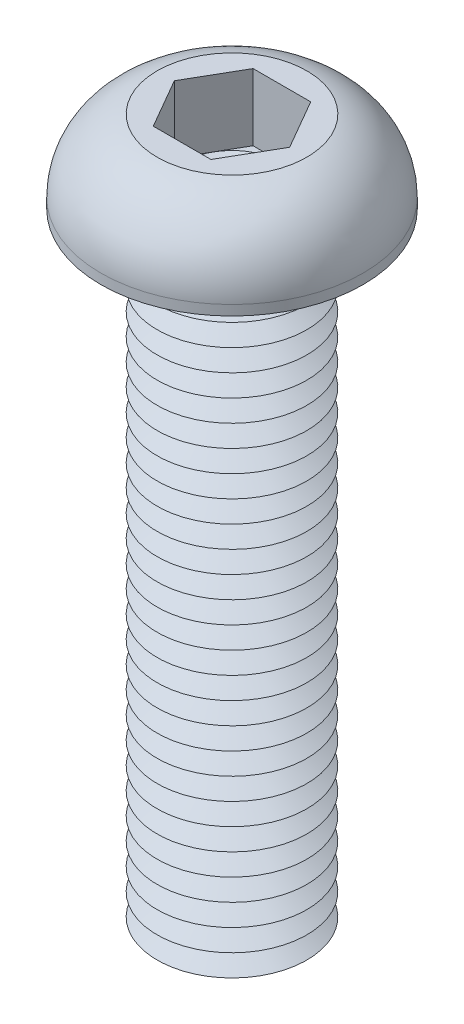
ISO-10303-21;
HEADER;
FILE_DESCRIPTION(('STEP AP214'),'2;1');
FILE_NAME('part.step','',(''),(''),'','','');
FILE_SCHEMA(('AUTOMOTIVE_DESIGN { 1 0 10303 214 1 1 1 1 }'));
ENDSEC;
DATA;
#1=APPLICATION_CONTEXT('core data for automotive mechanical design processes');
#2=APPLICATION_PROTOCOL_DEFINITION('international standard','automotive_design',2000,#1);
#3=PRODUCT_CONTEXT('',#1,'mechanical');
#4=PRODUCT('Part','Part','',(#3));
#5=PRODUCT_RELATED_PRODUCT_CATEGORY('part','',(#4));
#6=PRODUCT_DEFINITION_FORMATION('','',#4);
#7=PRODUCT_DEFINITION_CONTEXT('part definition',#1,'design');
#8=PRODUCT_DEFINITION('design','',#6,#7);
#9=PRODUCT_DEFINITION_SHAPE('','',#8);
#10=(LENGTH_UNIT() NAMED_UNIT(*) SI_UNIT(.MILLI.,.METRE.));
#11=(NAMED_UNIT(*) PLANE_ANGLE_UNIT() SI_UNIT($,.RADIAN.));
#12=(NAMED_UNIT(*) SI_UNIT($,.STERADIAN.) SOLID_ANGLE_UNIT());
#13=UNCERTAINTY_MEASURE_WITH_UNIT(LENGTH_MEASURE(1.E-05),#10,'distance_accuracy_value','');
#14=(GEOMETRIC_REPRESENTATION_CONTEXT(3) GLOBAL_UNCERTAINTY_ASSIGNED_CONTEXT((#13)) GLOBAL_UNIT_ASSIGNED_CONTEXT((#10,
#11,#12)) REPRESENTATION_CONTEXT('',''));
#15=CARTESIAN_POINT('',(0.,0.,0.));
#16=DIRECTION('',(0.,0.,1.));
#17=DIRECTION('',(1.,0.,0.));
#18=AXIS2_PLACEMENT_3D('',#15,#16,#17);
#19=CARTESIAN_POINT('',(0.,0.,0.));
#20=DIRECTION('',(0.,-1.,0.));
#21=DIRECTION('',(0.,0.,-1.));
#22=AXIS2_PLACEMENT_3D('',#19,#20,#21);
#23=TOROIDAL_SURFACE('',#22,6.875,0.875);
#24=CARTESIAN_POINT('',(0.,0.,-7.75));
#25=VERTEX_POINT('',#24);
#26=VERTEX_LOOP('',#25);
#27=FACE_BOUND('',#26,.T.);
#28=ADVANCED_FACE('P0_F12',(#27),#23,.T.);
#29=CLOSED_SHELL('',(#28));
#30=MANIFOLD_SOLID_BREP('P0_B1',#29);
#31=CARTESIAN_POINT('',(2.3094010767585,1.24,-4.));
#32=DIRECTION('',(0.,1.,0.));
#33=DIRECTION('',(0.,0.,1.));
#34=AXIS2_PLACEMENT_3D('',#31,#32,#33);
#35=PLANE('',#34);
#36=CARTESIAN_POINT('',(0.,1.24,0.));
#37=DIRECTION('',(0.,1.,0.));
#38=DIRECTION('',(0.,0.,1.));
#39=AXIS2_PLACEMENT_3D('',#36,#37,#38);
#40=CIRCLE('',#39,4.);
#41=CARTESIAN_POINT('',(0.,1.24,4.));
#42=VERTEX_POINT('',#41);
#43=CARTESIAN_POINT('',(3.46410161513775,1.24,2.));
#44=VERTEX_POINT('',#43);
#45=EDGE_CURVE('P1_E93',#42,#44,#40,.T.);
#46=ORIENTED_EDGE('',*,*,#45,.F.);
#47=DIRECTION('',(1.,0.,0.));
#48=VECTOR('',#47,1.);
#49=CARTESIAN_POINT('',(-2.3094010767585,1.24,4.));
#50=LINE('',#49,#48);
#51=CARTESIAN_POINT('',(2.3094010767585,1.24,4.));
#52=VERTEX_POINT('',#51);
#53=EDGE_CURVE('P1_E116',#42,#52,#50,.T.);
#54=ORIENTED_EDGE('',*,*,#53,.T.);
#55=DIRECTION('',(0.5,0.,-0.866025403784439));
#56=VECTOR('',#55,1.);
#57=CARTESIAN_POINT('',(2.3094010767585,1.24,4.));
#58=LINE('',#57,#56);
#59=EDGE_CURVE('P1_E112',#52,#44,#58,.T.);
#60=ORIENTED_EDGE('',*,*,#59,.T.);
#61=EDGE_LOOP('',(#46,#54,#60));
#62=FACE_BOUND('',#61,.T.);
#63=ADVANCED_FACE('P1_F15',(#62),#35,.T.);
#64=CARTESIAN_POINT('',(0.,1.24,0.));
#65=DIRECTION('',(0.,1.,0.));
#66=DIRECTION('',(0.,0.,1.));
#67=AXIS2_PLACEMENT_3D('',#64,#65,#66);
#68=CIRCLE('',#67,4.);
#69=CARTESIAN_POINT('',(3.46410161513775,1.24,-2.));
#70=VERTEX_POINT('',#69);
#71=EDGE_CURVE('P1_E10',#44,#70,#68,.T.);
#72=ORIENTED_EDGE('',*,*,#71,.F.);
#73=CARTESIAN_POINT('',(4.61880215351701,1.24,0.));
#74=VERTEX_POINT('',#73);
#75=EDGE_CURVE('P1_E104',#44,#74,#58,.T.);
#76=ORIENTED_EDGE('',*,*,#75,.T.);
#77=DIRECTION('',(-0.5,0.,-0.866025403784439));
#78=VECTOR('',#77,1.);
#79=CARTESIAN_POINT('',(4.61880215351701,1.24,0.));
#80=LINE('',#79,#78);
#81=EDGE_CURVE('P1_E107',#74,#70,#80,.T.);
#82=ORIENTED_EDGE('',*,*,#81,.T.);
#83=EDGE_LOOP('',(#72,#76,#82));
#84=FACE_BOUND('',#83,.T.);
#85=ADVANCED_FACE('P1_F103',(#84),#35,.T.);
#86=CARTESIAN_POINT('',(0.,1.24,-4.));
#87=VERTEX_POINT('',#86);
#88=EDGE_CURVE('P1_E24',#70,#87,#68,.T.);
#89=ORIENTED_EDGE('',*,*,#88,.F.);
#90=CARTESIAN_POINT('',(2.3094010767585,1.24,-4.));
#91=VERTEX_POINT('',#90);
#92=EDGE_CURVE('P1_E139',#70,#91,#80,.T.);
#93=ORIENTED_EDGE('',*,*,#92,.T.);
#94=DIRECTION('',(-1.,0.,0.));
#95=VECTOR('',#94,1.);
#96=CARTESIAN_POINT('',(2.3094010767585,1.24,-4.));
#97=LINE('',#96,#95);
#98=EDGE_CURVE('P1_E390',#91,#87,#97,.T.);
#99=ORIENTED_EDGE('',*,*,#98,.T.);
#100=EDGE_LOOP('',(#89,#93,#99));
#101=FACE_BOUND('',#100,.T.);
#102=ADVANCED_FACE('P1_F355',(#101),#35,.T.);
#103=CARTESIAN_POINT('',(-3.46410161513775,1.24,-2.));
#104=VERTEX_POINT('',#103);
#105=EDGE_CURVE('P1_E385',#87,#104,#68,.T.);
#106=ORIENTED_EDGE('',*,*,#105,.F.);
#107=CARTESIAN_POINT('',(-2.3094010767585,1.24,-4.));
#108=VERTEX_POINT('',#107);
#109=EDGE_CURVE('P1_E394',#87,#108,#97,.T.);
#110=ORIENTED_EDGE('',*,*,#109,.T.);
#111=DIRECTION('',(-0.5,0.,0.866025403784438));
#112=VECTOR('',#111,1.);
#113=CARTESIAN_POINT('',(-2.3094010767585,1.24,-4.));
#114=LINE('',#113,#112);
#115=EDGE_CURVE('P1_E389',#108,#104,#114,.T.);
#116=ORIENTED_EDGE('',*,*,#115,.T.);
#117=EDGE_LOOP('',(#106,#110,#116));
#118=FACE_BOUND('',#117,.T.);
#119=ADVANCED_FACE('P1_F369',(#118),#35,.T.);
#120=CARTESIAN_POINT('',(-3.46410161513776,1.24,2.));
#121=VERTEX_POINT('',#120);
#122=EDGE_CURVE('P1_E31',#104,#121,#68,.T.);
#123=ORIENTED_EDGE('',*,*,#122,.F.);
#124=CARTESIAN_POINT('',(-4.61880215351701,1.24,0.));
#125=VERTEX_POINT('',#124);
#126=EDGE_CURVE('P1_E381',#104,#125,#114,.T.);
#127=ORIENTED_EDGE('',*,*,#126,.T.);
#128=DIRECTION('',(0.5,0.,0.866025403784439));
#129=VECTOR('',#128,1.);
#130=CARTESIAN_POINT('',(-4.61880215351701,1.24,0.));
#131=LINE('',#130,#129);
#132=EDGE_CURVE('P1_E384',#125,#121,#131,.T.);
#133=ORIENTED_EDGE('',*,*,#132,.T.);
#134=EDGE_LOOP('',(#123,#127,#133));
#135=FACE_BOUND('',#134,.T.);
#136=ADVANCED_FACE('P1_F360',(#135),#35,.T.);
#137=CARTESIAN_POINT('',(0.,-48.25,0.));
#138=DIRECTION('',(0.,1.,0.));
#139=DIRECTION('',(0.,0.,1.));
#140=AXIS2_PLACEMENT_3D('',#137,#138,#139);
#141=CONICAL_SURFACE('',#140,4.48445554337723,1.0471975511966);
#142=CARTESIAN_POINT('',(0.,-47.375,0.));
#143=DIRECTION('',(0.,-1.,0.));
#144=DIRECTION('',(0.,0.,-1.));
#145=AXIS2_PLACEMENT_3D('',#142,#143,#144);
#146=CIRCLE('',#145,6.);
#147=CARTESIAN_POINT('',(0.,-47.375,-6.));
#148=VERTEX_POINT('',#147);
#149=EDGE_CURVE('P1_E317',#148,#148,#146,.T.);
#150=ORIENTED_EDGE('',*,*,#149,.T.);
#151=EDGE_LOOP('',(#150));
#152=FACE_BOUND('',#151,.T.);
#153=CARTESIAN_POINT('',(0.,-48.25,0.));
#154=DIRECTION('',(0.,-1.,0.));
#155=DIRECTION('',(0.,0.,-1.));
#156=AXIS2_PLACEMENT_3D('',#153,#154,#155);
#157=CIRCLE('',#156,4.48445554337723);
#158=CARTESIAN_POINT('',(0.,-48.25,-4.48445554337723));
#159=VERTEX_POINT('',#158);
#160=EDGE_CURVE('P1_E320',#159,#159,#157,.T.);
#161=ORIENTED_EDGE('',*,*,#160,.F.);
#162=EDGE_LOOP('',(#161));
#163=FACE_BOUND('',#162,.T.);
#164=ADVANCED_FACE('P1_F368',(#152,#163),#141,.T.);
#165=CARTESIAN_POINT('',(0.,-49.125,0.));
#166=DIRECTION('',(0.,-1.,0.));
#167=DIRECTION('',(0.,0.,-1.));
#168=AXIS2_PLACEMENT_3D('',#165,#166,#167);
#169=CONICAL_SURFACE('',#168,6.,1.0471975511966);
#170=ORIENTED_EDGE('',*,*,#160,.T.);
#171=EDGE_LOOP('',(#170));
#172=FACE_BOUND('',#171,.T.);
#173=CARTESIAN_POINT('',(0.,-49.125,0.));
#174=DIRECTION('',(0.,-1.,0.));
#175=DIRECTION('',(0.,0.,-1.));
#176=AXIS2_PLACEMENT_3D('',#173,#174,#175);
#177=CIRCLE('',#176,6.);
#178=CARTESIAN_POINT('',(0.,-49.125,-6.));
#179=VERTEX_POINT('',#178);
#180=EDGE_CURVE('P1_E323',#179,#179,#177,.T.);
#181=ORIENTED_EDGE('',*,*,#180,.F.);
#182=EDGE_LOOP('',(#181));
#183=FACE_BOUND('',#182,.T.);
#184=ADVANCED_FACE('P1_F375',(#172,#183),#169,.T.);
#185=CARTESIAN_POINT('',(0.,-50.,0.));
#186=DIRECTION('',(0.,1.,0.));
#187=DIRECTION('',(0.,0.,1.));
#188=AXIS2_PLACEMENT_3D('',#185,#186,#187);
#189=PLANE('',#188);
#190=CARTESIAN_POINT('',(0.,-50.,0.));
#191=DIRECTION('',(0.,-1.,0.));
#192=DIRECTION('',(0.,0.,-1.));
#193=AXIS2_PLACEMENT_3D('',#190,#191,#192);
#194=CIRCLE('',#193,4.48445554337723);
#195=CARTESIAN_POINT('',(0.,-50.,-4.48445554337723));
#196=VERTEX_POINT('',#195);
#197=EDGE_CURVE('P1_E326',#196,#196,#194,.T.);
#198=ORIENTED_EDGE('',*,*,#197,.T.);
#199=EDGE_LOOP('',(#198));
#200=FACE_BOUND('',#199,.T.);
#201=ADVANCED_FACE('P1_F453',(#200),#189,.F.);
#202=CARTESIAN_POINT('',(0.,-50.,0.));
#203=DIRECTION('',(0.,1.,0.));
#204=DIRECTION('',(0.,0.,1.));
#205=AXIS2_PLACEMENT_3D('',#202,#203,#204);
#206=CONICAL_SURFACE('',#205,4.48445554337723,1.0471975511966);
#207=ORIENTED_EDGE('',*,*,#180,.T.);
#208=EDGE_LOOP('',(#207));
#209=FACE_BOUND('',#208,.T.);
#210=ORIENTED_EDGE('',*,*,#197,.F.);
#211=EDGE_LOOP('',(#210));
#212=FACE_BOUND('',#211,.T.);
#213=ADVANCED_FACE('P1_F464',(#209,#212),#206,.T.);
#214=CARTESIAN_POINT('',(0.,-46.5,0.));
#215=DIRECTION('',(0.,1.,0.));
#216=DIRECTION('',(0.,0.,1.));
#217=AXIS2_PLACEMENT_3D('',#214,#215,#216);
#218=CONICAL_SURFACE('',#217,4.48445554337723,1.0471975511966);
#219=CARTESIAN_POINT('',(0.,-45.625,0.));
#220=DIRECTION('',(0.,-1.,0.));
#221=DIRECTION('',(0.,0.,-1.));
#222=AXIS2_PLACEMENT_3D('',#219,#220,#221);
#223=CIRCLE('',#222,6.);
#224=CARTESIAN_POINT('',(0.,-45.625,-6.));
#225=VERTEX_POINT('',#224);
#226=EDGE_CURVE('P1_E311',#225,#225,#223,.T.);
#227=ORIENTED_EDGE('',*,*,#226,.T.);
#228=EDGE_LOOP('',(#227));
#229=FACE_BOUND('',#228,.T.);
#230=CARTESIAN_POINT('',(0.,-46.5,0.));
#231=DIRECTION('',(0.,-1.,0.));
#232=DIRECTION('',(0.,0.,-1.));
#233=AXIS2_PLACEMENT_3D('',#230,#231,#232);
#234=CIRCLE('',#233,4.48445554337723);
#235=CARTESIAN_POINT('',(0.,-46.5,-4.48445554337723));
#236=VERTEX_POINT('',#235);
#237=EDGE_CURVE('P1_E314',#236,#236,#234,.T.);
#238=ORIENTED_EDGE('',*,*,#237,.F.);
#239=EDGE_LOOP('',(#238));
#240=FACE_BOUND('',#239,.T.);
#241=ADVANCED_FACE('P1_F473',(#229,#240),#218,.T.);
#242=CARTESIAN_POINT('',(0.,-47.375,0.));
#243=DIRECTION('',(0.,-1.,0.));
#244=DIRECTION('',(0.,0.,-1.));
#245=AXIS2_PLACEMENT_3D('',#242,#243,#244);
#246=CONICAL_SURFACE('',#245,6.,1.0471975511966);
#247=ORIENTED_EDGE('',*,*,#237,.T.);
#248=EDGE_LOOP('',(#247));
#249=FACE_BOUND('',#248,.T.);
#250=ORIENTED_EDGE('',*,*,#149,.F.);
#251=EDGE_LOOP('',(#250));
#252=FACE_BOUND('',#251,.T.);
#253=ADVANCED_FACE('P1_F482',(#249,#252),#246,.T.);
#254=CARTESIAN_POINT('',(0.,-44.75,0.));
#255=DIRECTION('',(0.,1.,0.));
#256=DIRECTION('',(0.,0.,1.));
#257=AXIS2_PLACEMENT_3D('',#254,#255,#256);
#258=CONICAL_SURFACE('',#257,4.48445554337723,1.0471975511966);
#259=CARTESIAN_POINT('',(0.,-43.875,0.));
#260=DIRECTION('',(0.,-1.,0.));
#261=DIRECTION('',(0.,0.,-1.));
#262=AXIS2_PLACEMENT_3D('',#259,#260,#261);
#263=CIRCLE('',#262,6.);
#264=CARTESIAN_POINT('',(0.,-43.875,-6.));
#265=VERTEX_POINT('',#264);
#266=EDGE_CURVE('P1_E305',#265,#265,#263,.T.);
#267=ORIENTED_EDGE('',*,*,#266,.T.);
#268=EDGE_LOOP('',(#267));
#269=FACE_BOUND('',#268,.T.);
#270=CARTESIAN_POINT('',(0.,-44.75,0.));
#271=DIRECTION('',(0.,-1.,0.));
#272=DIRECTION('',(0.,0.,-1.));
#273=AXIS2_PLACEMENT_3D('',#270,#271,#272);
#274=CIRCLE('',#273,4.48445554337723);
#275=CARTESIAN_POINT('',(0.,-44.75,-4.48445554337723));
#276=VERTEX_POINT('',#275);
#277=EDGE_CURVE('P1_E308',#276,#276,#274,.T.);
#278=ORIENTED_EDGE('',*,*,#277,.F.);
#279=EDGE_LOOP('',(#278));
#280=FACE_BOUND('',#279,.T.);
#281=ADVANCED_FACE('P1_F492',(#269,#280),#258,.T.);
#282=CARTESIAN_POINT('',(0.,-45.625,0.));
#283=DIRECTION('',(0.,-1.,0.));
#284=DIRECTION('',(0.,0.,-1.));
#285=AXIS2_PLACEMENT_3D('',#282,#283,#284);
#286=CONICAL_SURFACE('',#285,6.,1.0471975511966);
#287=ORIENTED_EDGE('',*,*,#277,.T.);
#288=EDGE_LOOP('',(#287));
#289=FACE_BOUND('',#288,.T.);
#290=ORIENTED_EDGE('',*,*,#226,.F.);
#291=EDGE_LOOP('',(#290));
#292=FACE_BOUND('',#291,.T.);
#293=ADVANCED_FACE('P1_F502',(#289,#292),#286,.T.);
#294=CARTESIAN_POINT('',(0.,-43.,0.));
#295=DIRECTION('',(0.,1.,0.));
#296=DIRECTION('',(0.,0.,1.));
#297=AXIS2_PLACEMENT_3D('',#294,#295,#296);
#298=CONICAL_SURFACE('',#297,4.48445554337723,1.0471975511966);
#299=CARTESIAN_POINT('',(0.,-42.125,0.));
#300=DIRECTION('',(0.,-1.,0.));
#301=DIRECTION('',(0.,0.,-1.));
#302=AXIS2_PLACEMENT_3D('',#299,#300,#301);
#303=CIRCLE('',#302,6.);
#304=CARTESIAN_POINT('',(0.,-42.125,-6.));
#305=VERTEX_POINT('',#304);
#306=EDGE_CURVE('P1_E299',#305,#305,#303,.T.);
#307=ORIENTED_EDGE('',*,*,#306,.T.);
#308=EDGE_LOOP('',(#307));
#309=FACE_BOUND('',#308,.T.);
#310=CARTESIAN_POINT('',(0.,-43.,0.));
#311=DIRECTION('',(0.,-1.,0.));
#312=DIRECTION('',(0.,0.,-1.));
#313=AXIS2_PLACEMENT_3D('',#310,#311,#312);
#314=CIRCLE('',#313,4.48445554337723);
#315=CARTESIAN_POINT('',(0.,-43.,-4.48445554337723));
#316=VERTEX_POINT('',#315);
#317=EDGE_CURVE('P1_E302',#316,#316,#314,.T.);
#318=ORIENTED_EDGE('',*,*,#317,.F.);
#319=EDGE_LOOP('',(#318));
#320=FACE_BOUND('',#319,.T.);
#321=ADVANCED_FACE('P1_F512',(#309,#320),#298,.T.);
#322=CARTESIAN_POINT('',(0.,-43.875,0.));
#323=DIRECTION('',(0.,-1.,0.));
#324=DIRECTION('',(0.,0.,-1.));
#325=AXIS2_PLACEMENT_3D('',#322,#323,#324);
#326=CONICAL_SURFACE('',#325,6.,1.0471975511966);
#327=ORIENTED_EDGE('',*,*,#317,.T.);
#328=EDGE_LOOP('',(#327));
#329=FACE_BOUND('',#328,.T.);
#330=ORIENTED_EDGE('',*,*,#266,.F.);
#331=EDGE_LOOP('',(#330));
#332=FACE_BOUND('',#331,.T.);
#333=ADVANCED_FACE('P1_F522',(#329,#332),#326,.T.);
#334=CARTESIAN_POINT('',(0.,-41.25,0.));
#335=DIRECTION('',(0.,1.,0.));
#336=DIRECTION('',(0.,0.,1.));
#337=AXIS2_PLACEMENT_3D('',#334,#335,#336);
#338=CONICAL_SURFACE('',#337,4.48445554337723,1.0471975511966);
#339=CARTESIAN_POINT('',(0.,-40.375,0.));
#340=DIRECTION('',(0.,-1.,0.));
#341=DIRECTION('',(0.,0.,-1.));
#342=AXIS2_PLACEMENT_3D('',#339,#340,#341);
#343=CIRCLE('',#342,6.);
#344=CARTESIAN_POINT('',(0.,-40.375,-6.));
#345=VERTEX_POINT('',#344);
#346=EDGE_CURVE('P1_E293',#345,#345,#343,.T.);
#347=ORIENTED_EDGE('',*,*,#346,.T.);
#348=EDGE_LOOP('',(#347));
#349=FACE_BOUND('',#348,.T.);
#350=CARTESIAN_POINT('',(0.,-41.25,0.));
#351=DIRECTION('',(0.,-1.,0.));
#352=DIRECTION('',(0.,0.,-1.));
#353=AXIS2_PLACEMENT_3D('',#350,#351,#352);
#354=CIRCLE('',#353,4.48445554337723);
#355=CARTESIAN_POINT('',(0.,-41.25,-4.48445554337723));
#356=VERTEX_POINT('',#355);
#357=EDGE_CURVE('P1_E296',#356,#356,#354,.T.);
#358=ORIENTED_EDGE('',*,*,#357,.F.);
#359=EDGE_LOOP('',(#358));
#360=FACE_BOUND('',#359,.T.);
#361=ADVANCED_FACE('P1_F532',(#349,#360),#338,.T.);
#362=CARTESIAN_POINT('',(0.,-42.125,0.));
#363=DIRECTION('',(0.,-1.,0.));
#364=DIRECTION('',(0.,0.,-1.));
#365=AXIS2_PLACEMENT_3D('',#362,#363,#364);
#366=CONICAL_SURFACE('',#365,6.,1.0471975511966);
#367=ORIENTED_EDGE('',*,*,#357,.T.);
#368=EDGE_LOOP('',(#367));
#369=FACE_BOUND('',#368,.T.);
#370=ORIENTED_EDGE('',*,*,#306,.F.);
#371=EDGE_LOOP('',(#370));
#372=FACE_BOUND('',#371,.T.);
#373=ADVANCED_FACE('P1_F542',(#369,#372),#366,.T.);
#374=CARTESIAN_POINT('',(0.,-39.5,0.));
#375=DIRECTION('',(0.,1.,0.));
#376=DIRECTION('',(0.,0.,1.));
#377=AXIS2_PLACEMENT_3D('',#374,#375,#376);
#378=CONICAL_SURFACE('',#377,4.48445554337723,1.0471975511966);
#379=CARTESIAN_POINT('',(0.,-38.625,0.));
#380=DIRECTION('',(0.,-1.,0.));
#381=DIRECTION('',(0.,0.,-1.));
#382=AXIS2_PLACEMENT_3D('',#379,#380,#381);
#383=CIRCLE('',#382,6.);
#384=CARTESIAN_POINT('',(0.,-38.625,-6.));
#385=VERTEX_POINT('',#384);
#386=EDGE_CURVE('P1_E287',#385,#385,#383,.T.);
#387=ORIENTED_EDGE('',*,*,#386,.T.);
#388=EDGE_LOOP('',(#387));
#389=FACE_BOUND('',#388,.T.);
#390=CARTESIAN_POINT('',(0.,-39.5,0.));
#391=DIRECTION('',(0.,-1.,0.));
#392=DIRECTION('',(0.,0.,-1.));
#393=AXIS2_PLACEMENT_3D('',#390,#391,#392);
#394=CIRCLE('',#393,4.48445554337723);
#395=CARTESIAN_POINT('',(0.,-39.5,-4.48445554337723));
#396=VERTEX_POINT('',#395);
#397=EDGE_CURVE('P1_E290',#396,#396,#394,.T.);
#398=ORIENTED_EDGE('',*,*,#397,.F.);
#399=EDGE_LOOP('',(#398));
#400=FACE_BOUND('',#399,.T.);
#401=ADVANCED_FACE('P1_F552',(#389,#400),#378,.T.);
#402=CARTESIAN_POINT('',(0.,-40.375,0.));
#403=DIRECTION('',(0.,-1.,0.));
#404=DIRECTION('',(0.,0.,-1.));
#405=AXIS2_PLACEMENT_3D('',#402,#403,#404);
#406=CONICAL_SURFACE('',#405,6.,1.0471975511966);
#407=ORIENTED_EDGE('',*,*,#397,.T.);
#408=EDGE_LOOP('',(#407));
#409=FACE_BOUND('',#408,.T.);
#410=ORIENTED_EDGE('',*,*,#346,.F.);
#411=EDGE_LOOP('',(#410));
#412=FACE_BOUND('',#411,.T.);
#413=ADVANCED_FACE('P1_F562',(#409,#412),#406,.T.);
#414=CARTESIAN_POINT('',(0.,-37.75,0.));
#415=DIRECTION('',(0.,1.,0.));
#416=DIRECTION('',(0.,0.,1.));
#417=AXIS2_PLACEMENT_3D('',#414,#415,#416);
#418=CONICAL_SURFACE('',#417,4.48445554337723,1.0471975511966);
#419=CARTESIAN_POINT('',(0.,-36.875,0.));
#420=DIRECTION('',(0.,-1.,0.));
#421=DIRECTION('',(0.,0.,-1.));
#422=AXIS2_PLACEMENT_3D('',#419,#420,#421);
#423=CIRCLE('',#422,6.);
#424=CARTESIAN_POINT('',(0.,-36.875,-6.));
#425=VERTEX_POINT('',#424);
#426=EDGE_CURVE('P1_E281',#425,#425,#423,.T.);
#427=ORIENTED_EDGE('',*,*,#426,.T.);
#428=EDGE_LOOP('',(#427));
#429=FACE_BOUND('',#428,.T.);
#430=CARTESIAN_POINT('',(0.,-37.75,0.));
#431=DIRECTION('',(0.,-1.,0.));
#432=DIRECTION('',(0.,0.,-1.));
#433=AXIS2_PLACEMENT_3D('',#430,#431,#432);
#434=CIRCLE('',#433,4.48445554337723);
#435=CARTESIAN_POINT('',(0.,-37.75,-4.48445554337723));
#436=VERTEX_POINT('',#435);
#437=EDGE_CURVE('P1_E284',#436,#436,#434,.T.);
#438=ORIENTED_EDGE('',*,*,#437,.F.);
#439=EDGE_LOOP('',(#438));
#440=FACE_BOUND('',#439,.T.);
#441=ADVANCED_FACE('P1_F572',(#429,#440),#418,.T.);
#442=CARTESIAN_POINT('',(0.,-38.625,0.));
#443=DIRECTION('',(0.,-1.,0.));
#444=DIRECTION('',(0.,0.,-1.));
#445=AXIS2_PLACEMENT_3D('',#442,#443,#444);
#446=CONICAL_SURFACE('',#445,6.,1.0471975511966);
#447=ORIENTED_EDGE('',*,*,#437,.T.);
#448=EDGE_LOOP('',(#447));
#449=FACE_BOUND('',#448,.T.);
#450=ORIENTED_EDGE('',*,*,#386,.F.);
#451=EDGE_LOOP('',(#450));
#452=FACE_BOUND('',#451,.T.);
#453=ADVANCED_FACE('P1_F582',(#449,#452),#446,.T.);
#454=CARTESIAN_POINT('',(0.,-36.,0.));
#455=DIRECTION('',(0.,1.,0.));
#456=DIRECTION('',(0.,0.,1.));
#457=AXIS2_PLACEMENT_3D('',#454,#455,#456);
#458=CONICAL_SURFACE('',#457,4.48445554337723,1.0471975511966);
#459=CARTESIAN_POINT('',(0.,-35.125,0.));
#460=DIRECTION('',(0.,-1.,0.));
#461=DIRECTION('',(0.,0.,-1.));
#462=AXIS2_PLACEMENT_3D('',#459,#460,#461);
#463=CIRCLE('',#462,6.);
#464=CARTESIAN_POINT('',(0.,-35.125,-6.));
#465=VERTEX_POINT('',#464);
#466=EDGE_CURVE('P1_E275',#465,#465,#463,.T.);
#467=ORIENTED_EDGE('',*,*,#466,.T.);
#468=EDGE_LOOP('',(#467));
#469=FACE_BOUND('',#468,.T.);
#470=CARTESIAN_POINT('',(0.,-36.,0.));
#471=DIRECTION('',(0.,-1.,0.));
#472=DIRECTION('',(0.,0.,-1.));
#473=AXIS2_PLACEMENT_3D('',#470,#471,#472);
#474=CIRCLE('',#473,4.48445554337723);
#475=CARTESIAN_POINT('',(0.,-36.,-4.48445554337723));
#476=VERTEX_POINT('',#475);
#477=EDGE_CURVE('P1_E278',#476,#476,#474,.T.);
#478=ORIENTED_EDGE('',*,*,#477,.F.);
#479=EDGE_LOOP('',(#478));
#480=FACE_BOUND('',#479,.T.);
#481=ADVANCED_FACE('P1_F592',(#469,#480),#458,.T.);
#482=CARTESIAN_POINT('',(0.,-36.875,0.));
#483=DIRECTION('',(0.,-1.,0.));
#484=DIRECTION('',(0.,0.,-1.));
#485=AXIS2_PLACEMENT_3D('',#482,#483,#484);
#486=CONICAL_SURFACE('',#485,6.,1.0471975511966);
#487=ORIENTED_EDGE('',*,*,#477,.T.);
#488=EDGE_LOOP('',(#487));
#489=FACE_BOUND('',#488,.T.);
#490=ORIENTED_EDGE('',*,*,#426,.F.);
#491=EDGE_LOOP('',(#490));
#492=FACE_BOUND('',#491,.T.);
#493=ADVANCED_FACE('P1_F602',(#489,#492),#486,.T.);
#494=CARTESIAN_POINT('',(0.,-34.25,0.));
#495=DIRECTION('',(0.,1.,0.));
#496=DIRECTION('',(0.,0.,1.));
#497=AXIS2_PLACEMENT_3D('',#494,#495,#496);
#498=CONICAL_SURFACE('',#497,4.48445554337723,1.0471975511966);
#499=CARTESIAN_POINT('',(0.,-33.375,0.));
#500=DIRECTION('',(0.,-1.,0.));
#501=DIRECTION('',(0.,0.,-1.));
#502=AXIS2_PLACEMENT_3D('',#499,#500,#501);
#503=CIRCLE('',#502,6.);
#504=CARTESIAN_POINT('',(0.,-33.375,-6.));
#505=VERTEX_POINT('',#504);
#506=EDGE_CURVE('P1_E269',#505,#505,#503,.T.);
#507=ORIENTED_EDGE('',*,*,#506,.T.);
#508=EDGE_LOOP('',(#507));
#509=FACE_BOUND('',#508,.T.);
#510=CARTESIAN_POINT('',(0.,-34.25,0.));
#511=DIRECTION('',(0.,-1.,0.));
#512=DIRECTION('',(0.,0.,-1.));
#513=AXIS2_PLACEMENT_3D('',#510,#511,#512);
#514=CIRCLE('',#513,4.48445554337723);
#515=CARTESIAN_POINT('',(0.,-34.25,-4.48445554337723));
#516=VERTEX_POINT('',#515);
#517=EDGE_CURVE('P1_E272',#516,#516,#514,.T.);
#518=ORIENTED_EDGE('',*,*,#517,.F.);
#519=EDGE_LOOP('',(#518));
#520=FACE_BOUND('',#519,.T.);
#521=ADVANCED_FACE('P1_F612',(#509,#520),#498,.T.);
#522=CARTESIAN_POINT('',(0.,-35.125,0.));
#523=DIRECTION('',(0.,-1.,0.));
#524=DIRECTION('',(0.,0.,-1.));
#525=AXIS2_PLACEMENT_3D('',#522,#523,#524);
#526=CONICAL_SURFACE('',#525,6.,1.0471975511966);
#527=ORIENTED_EDGE('',*,*,#517,.T.);
#528=EDGE_LOOP('',(#527));
#529=FACE_BOUND('',#528,.T.);
#530=ORIENTED_EDGE('',*,*,#466,.F.);
#531=EDGE_LOOP('',(#530));
#532=FACE_BOUND('',#531,.T.);
#533=ADVANCED_FACE('P1_F622',(#529,#532),#526,.T.);
#534=CARTESIAN_POINT('',(0.,-32.5,0.));
#535=DIRECTION('',(0.,1.,0.));
#536=DIRECTION('',(0.,0.,1.));
#537=AXIS2_PLACEMENT_3D('',#534,#535,#536);
#538=CONICAL_SURFACE('',#537,4.48445554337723,1.0471975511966);
#539=CARTESIAN_POINT('',(0.,-31.625,0.));
#540=DIRECTION('',(0.,-1.,0.));
#541=DIRECTION('',(0.,0.,-1.));
#542=AXIS2_PLACEMENT_3D('',#539,#540,#541);
#543=CIRCLE('',#542,6.);
#544=CARTESIAN_POINT('',(0.,-31.625,-6.));
#545=VERTEX_POINT('',#544);
#546=EDGE_CURVE('P1_E263',#545,#545,#543,.T.);
#547=ORIENTED_EDGE('',*,*,#546,.T.);
#548=EDGE_LOOP('',(#547));
#549=FACE_BOUND('',#548,.T.);
#550=CARTESIAN_POINT('',(0.,-32.5,0.));
#551=DIRECTION('',(0.,-1.,0.));
#552=DIRECTION('',(0.,0.,-1.));
#553=AXIS2_PLACEMENT_3D('',#550,#551,#552);
#554=CIRCLE('',#553,4.48445554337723);
#555=CARTESIAN_POINT('',(0.,-32.5,-4.48445554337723));
#556=VERTEX_POINT('',#555);
#557=EDGE_CURVE('P1_E266',#556,#556,#554,.T.);
#558=ORIENTED_EDGE('',*,*,#557,.F.);
#559=EDGE_LOOP('',(#558));
#560=FACE_BOUND('',#559,.T.);
#561=ADVANCED_FACE('P1_F632',(#549,#560),#538,.T.);
#562=CARTESIAN_POINT('',(0.,-33.375,0.));
#563=DIRECTION('',(0.,-1.,0.));
#564=DIRECTION('',(0.,0.,-1.));
#565=AXIS2_PLACEMENT_3D('',#562,#563,#564);
#566=CONICAL_SURFACE('',#565,6.,1.0471975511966);
#567=ORIENTED_EDGE('',*,*,#557,.T.);
#568=EDGE_LOOP('',(#567));
#569=FACE_BOUND('',#568,.T.);
#570=ORIENTED_EDGE('',*,*,#506,.F.);
#571=EDGE_LOOP('',(#570));
#572=FACE_BOUND('',#571,.T.);
#573=ADVANCED_FACE('P1_F642',(#569,#572),#566,.T.);
#574=CARTESIAN_POINT('',(0.,-30.75,0.));
#575=DIRECTION('',(0.,1.,0.));
#576=DIRECTION('',(0.,0.,1.));
#577=AXIS2_PLACEMENT_3D('',#574,#575,#576);
#578=CONICAL_SURFACE('',#577,4.48445554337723,1.0471975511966);
#579=CARTESIAN_POINT('',(0.,-29.875,0.));
#580=DIRECTION('',(0.,-1.,0.));
#581=DIRECTION('',(0.,0.,-1.));
#582=AXIS2_PLACEMENT_3D('',#579,#580,#581);
#583=CIRCLE('',#582,6.);
#584=CARTESIAN_POINT('',(0.,-29.875,-6.));
#585=VERTEX_POINT('',#584);
#586=EDGE_CURVE('P1_E257',#585,#585,#583,.T.);
#587=ORIENTED_EDGE('',*,*,#586,.T.);
#588=EDGE_LOOP('',(#587));
#589=FACE_BOUND('',#588,.T.);
#590=CARTESIAN_POINT('',(0.,-30.75,0.));
#591=DIRECTION('',(0.,-1.,0.));
#592=DIRECTION('',(0.,0.,-1.));
#593=AXIS2_PLACEMENT_3D('',#590,#591,#592);
#594=CIRCLE('',#593,4.48445554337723);
#595=CARTESIAN_POINT('',(0.,-30.75,-4.48445554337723));
#596=VERTEX_POINT('',#595);
#597=EDGE_CURVE('P1_E260',#596,#596,#594,.T.);
#598=ORIENTED_EDGE('',*,*,#597,.F.);
#599=EDGE_LOOP('',(#598));
#600=FACE_BOUND('',#599,.T.);
#601=ADVANCED_FACE('P1_F652',(#589,#600),#578,.T.);
#602=CARTESIAN_POINT('',(0.,-31.625,0.));
#603=DIRECTION('',(0.,-1.,0.));
#604=DIRECTION('',(0.,0.,-1.));
#605=AXIS2_PLACEMENT_3D('',#602,#603,#604);
#606=CONICAL_SURFACE('',#605,6.,1.0471975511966);
#607=ORIENTED_EDGE('',*,*,#597,.T.);
#608=EDGE_LOOP('',(#607));
#609=FACE_BOUND('',#608,.T.);
#610=ORIENTED_EDGE('',*,*,#546,.F.);
#611=EDGE_LOOP('',(#610));
#612=FACE_BOUND('',#611,.T.);
#613=ADVANCED_FACE('P1_F662',(#609,#612),#606,.T.);
#614=CARTESIAN_POINT('',(0.,-29.,0.));
#615=DIRECTION('',(0.,1.,0.));
#616=DIRECTION('',(0.,0.,1.));
#617=AXIS2_PLACEMENT_3D('',#614,#615,#616);
#618=CONICAL_SURFACE('',#617,4.48445554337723,1.0471975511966);
#619=CARTESIAN_POINT('',(0.,-28.125,0.));
#620=DIRECTION('',(0.,-1.,0.));
#621=DIRECTION('',(0.,0.,-1.));
#622=AXIS2_PLACEMENT_3D('',#619,#620,#621);
#623=CIRCLE('',#622,6.);
#624=CARTESIAN_POINT('',(0.,-28.125,-6.));
#625=VERTEX_POINT('',#624);
#626=EDGE_CURVE('P1_E251',#625,#625,#623,.T.);
#627=ORIENTED_EDGE('',*,*,#626,.T.);
#628=EDGE_LOOP('',(#627));
#629=FACE_BOUND('',#628,.T.);
#630=CARTESIAN_POINT('',(0.,-29.,0.));
#631=DIRECTION('',(0.,-1.,0.));
#632=DIRECTION('',(0.,0.,-1.));
#633=AXIS2_PLACEMENT_3D('',#630,#631,#632);
#634=CIRCLE('',#633,4.48445554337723);
#635=CARTESIAN_POINT('',(0.,-29.,-4.48445554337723));
#636=VERTEX_POINT('',#635);
#637=EDGE_CURVE('P1_E254',#636,#636,#634,.T.);
#638=ORIENTED_EDGE('',*,*,#637,.F.);
#639=EDGE_LOOP('',(#638));
#640=FACE_BOUND('',#639,.T.);
#641=ADVANCED_FACE('P1_F672',(#629,#640),#618,.T.);
#642=CARTESIAN_POINT('',(0.,-29.875,0.));
#643=DIRECTION('',(0.,-1.,0.));
#644=DIRECTION('',(0.,0.,-1.));
#645=AXIS2_PLACEMENT_3D('',#642,#643,#644);
#646=CONICAL_SURFACE('',#645,6.,1.0471975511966);
#647=ORIENTED_EDGE('',*,*,#637,.T.);
#648=EDGE_LOOP('',(#647));
#649=FACE_BOUND('',#648,.T.);
#650=ORIENTED_EDGE('',*,*,#586,.F.);
#651=EDGE_LOOP('',(#650));
#652=FACE_BOUND('',#651,.T.);
#653=ADVANCED_FACE('P1_F682',(#649,#652),#646,.T.);
#654=CARTESIAN_POINT('',(0.,-27.25,0.));
#655=DIRECTION('',(0.,1.,0.));
#656=DIRECTION('',(0.,0.,1.));
#657=AXIS2_PLACEMENT_3D('',#654,#655,#656);
#658=CONICAL_SURFACE('',#657,4.48445554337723,1.0471975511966);
#659=CARTESIAN_POINT('',(0.,-26.375,0.));
#660=DIRECTION('',(0.,-1.,0.));
#661=DIRECTION('',(0.,0.,-1.));
#662=AXIS2_PLACEMENT_3D('',#659,#660,#661);
#663=CIRCLE('',#662,6.);
#664=CARTESIAN_POINT('',(0.,-26.375,-6.));
#665=VERTEX_POINT('',#664);
#666=EDGE_CURVE('P1_E245',#665,#665,#663,.T.);
#667=ORIENTED_EDGE('',*,*,#666,.T.);
#668=EDGE_LOOP('',(#667));
#669=FACE_BOUND('',#668,.T.);
#670=CARTESIAN_POINT('',(0.,-27.25,0.));
#671=DIRECTION('',(0.,-1.,0.));
#672=DIRECTION('',(0.,0.,-1.));
#673=AXIS2_PLACEMENT_3D('',#670,#671,#672);
#674=CIRCLE('',#673,4.48445554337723);
#675=CARTESIAN_POINT('',(0.,-27.25,-4.48445554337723));
#676=VERTEX_POINT('',#675);
#677=EDGE_CURVE('P1_E248',#676,#676,#674,.T.);
#678=ORIENTED_EDGE('',*,*,#677,.F.);
#679=EDGE_LOOP('',(#678));
#680=FACE_BOUND('',#679,.T.);
#681=ADVANCED_FACE('P1_F692',(#669,#680),#658,.T.);
#682=CARTESIAN_POINT('',(0.,-28.125,0.));
#683=DIRECTION('',(0.,-1.,0.));
#684=DIRECTION('',(0.,0.,-1.));
#685=AXIS2_PLACEMENT_3D('',#682,#683,#684);
#686=CONICAL_SURFACE('',#685,6.,1.0471975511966);
#687=ORIENTED_EDGE('',*,*,#677,.T.);
#688=EDGE_LOOP('',(#687));
#689=FACE_BOUND('',#688,.T.);
#690=ORIENTED_EDGE('',*,*,#626,.F.);
#691=EDGE_LOOP('',(#690));
#692=FACE_BOUND('',#691,.T.);
#693=ADVANCED_FACE('P1_F702',(#689,#692),#686,.T.);
#694=CARTESIAN_POINT('',(0.,-25.5,0.));
#695=DIRECTION('',(0.,1.,0.));
#696=DIRECTION('',(0.,0.,1.));
#697=AXIS2_PLACEMENT_3D('',#694,#695,#696);
#698=CONICAL_SURFACE('',#697,4.48445554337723,1.0471975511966);
#699=CARTESIAN_POINT('',(0.,-24.625,0.));
#700=DIRECTION('',(0.,-1.,0.));
#701=DIRECTION('',(0.,0.,-1.));
#702=AXIS2_PLACEMENT_3D('',#699,#700,#701);
#703=CIRCLE('',#702,6.);
#704=CARTESIAN_POINT('',(0.,-24.625,-6.));
#705=VERTEX_POINT('',#704);
#706=EDGE_CURVE('P1_E239',#705,#705,#703,.T.);
#707=ORIENTED_EDGE('',*,*,#706,.T.);
#708=EDGE_LOOP('',(#707));
#709=FACE_BOUND('',#708,.T.);
#710=CARTESIAN_POINT('',(0.,-25.5,0.));
#711=DIRECTION('',(0.,-1.,0.));
#712=DIRECTION('',(0.,0.,-1.));
#713=AXIS2_PLACEMENT_3D('',#710,#711,#712);
#714=CIRCLE('',#713,4.48445554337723);
#715=CARTESIAN_POINT('',(0.,-25.5,-4.48445554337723));
#716=VERTEX_POINT('',#715);
#717=EDGE_CURVE('P1_E242',#716,#716,#714,.T.);
#718=ORIENTED_EDGE('',*,*,#717,.F.);
#719=EDGE_LOOP('',(#718));
#720=FACE_BOUND('',#719,.T.);
#721=ADVANCED_FACE('P1_F712',(#709,#720),#698,.T.);
#722=CARTESIAN_POINT('',(0.,-26.375,0.));
#723=DIRECTION('',(0.,-1.,0.));
#724=DIRECTION('',(0.,0.,-1.));
#725=AXIS2_PLACEMENT_3D('',#722,#723,#724);
#726=CONICAL_SURFACE('',#725,6.,1.0471975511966);
#727=ORIENTED_EDGE('',*,*,#717,.T.);
#728=EDGE_LOOP('',(#727));
#729=FACE_BOUND('',#728,.T.);
#730=ORIENTED_EDGE('',*,*,#666,.F.);
#731=EDGE_LOOP('',(#730));
#732=FACE_BOUND('',#731,.T.);
#733=ADVANCED_FACE('P1_F722',(#729,#732),#726,.T.);
#734=CARTESIAN_POINT('',(0.,-23.75,0.));
#735=DIRECTION('',(0.,1.,0.));
#736=DIRECTION('',(0.,0.,1.));
#737=AXIS2_PLACEMENT_3D('',#734,#735,#736);
#738=CONICAL_SURFACE('',#737,4.48445554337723,1.0471975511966);
#739=CARTESIAN_POINT('',(0.,-22.875,0.));
#740=DIRECTION('',(0.,-1.,0.));
#741=DIRECTION('',(0.,0.,-1.));
#742=AXIS2_PLACEMENT_3D('',#739,#740,#741);
#743=CIRCLE('',#742,6.);
#744=CARTESIAN_POINT('',(0.,-22.875,-6.));
#745=VERTEX_POINT('',#744);
#746=EDGE_CURVE('P1_E233',#745,#745,#743,.T.);
#747=ORIENTED_EDGE('',*,*,#746,.T.);
#748=EDGE_LOOP('',(#747));
#749=FACE_BOUND('',#748,.T.);
#750=CARTESIAN_POINT('',(0.,-23.75,0.));
#751=DIRECTION('',(0.,-1.,0.));
#752=DIRECTION('',(0.,0.,-1.));
#753=AXIS2_PLACEMENT_3D('',#750,#751,#752);
#754=CIRCLE('',#753,4.48445554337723);
#755=CARTESIAN_POINT('',(0.,-23.75,-4.48445554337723));
#756=VERTEX_POINT('',#755);
#757=EDGE_CURVE('P1_E236',#756,#756,#754,.T.);
#758=ORIENTED_EDGE('',*,*,#757,.F.);
#759=EDGE_LOOP('',(#758));
#760=FACE_BOUND('',#759,.T.);
#761=ADVANCED_FACE('P1_F732',(#749,#760),#738,.T.);
#762=CARTESIAN_POINT('',(0.,-24.625,0.));
#763=DIRECTION('',(0.,-1.,0.));
#764=DIRECTION('',(0.,0.,-1.));
#765=AXIS2_PLACEMENT_3D('',#762,#763,#764);
#766=CONICAL_SURFACE('',#765,6.,1.0471975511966);
#767=ORIENTED_EDGE('',*,*,#757,.T.);
#768=EDGE_LOOP('',(#767));
#769=FACE_BOUND('',#768,.T.);
#770=ORIENTED_EDGE('',*,*,#706,.F.);
#771=EDGE_LOOP('',(#770));
#772=FACE_BOUND('',#771,.T.);
#773=ADVANCED_FACE('P1_F742',(#769,#772),#766,.T.);
#774=CARTESIAN_POINT('',(0.,-22.,0.));
#775=DIRECTION('',(0.,1.,0.));
#776=DIRECTION('',(0.,0.,1.));
#777=AXIS2_PLACEMENT_3D('',#774,#775,#776);
#778=CONICAL_SURFACE('',#777,4.48445554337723,1.0471975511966);
#779=CARTESIAN_POINT('',(0.,-21.125,0.));
#780=DIRECTION('',(0.,-1.,0.));
#781=DIRECTION('',(0.,0.,-1.));
#782=AXIS2_PLACEMENT_3D('',#779,#780,#781);
#783=CIRCLE('',#782,6.);
#784=CARTESIAN_POINT('',(0.,-21.125,-6.));
#785=VERTEX_POINT('',#784);
#786=EDGE_CURVE('P1_E227',#785,#785,#783,.T.);
#787=ORIENTED_EDGE('',*,*,#786,.T.);
#788=EDGE_LOOP('',(#787));
#789=FACE_BOUND('',#788,.T.);
#790=CARTESIAN_POINT('',(0.,-22.,0.));
#791=DIRECTION('',(0.,-1.,0.));
#792=DIRECTION('',(0.,0.,-1.));
#793=AXIS2_PLACEMENT_3D('',#790,#791,#792);
#794=CIRCLE('',#793,4.48445554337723);
#795=CARTESIAN_POINT('',(0.,-22.,-4.48445554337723));
#796=VERTEX_POINT('',#795);
#797=EDGE_CURVE('P1_E230',#796,#796,#794,.T.);
#798=ORIENTED_EDGE('',*,*,#797,.F.);
#799=EDGE_LOOP('',(#798));
#800=FACE_BOUND('',#799,.T.);
#801=ADVANCED_FACE('P1_F752',(#789,#800),#778,.T.);
#802=CARTESIAN_POINT('',(0.,-22.875,0.));
#803=DIRECTION('',(0.,-1.,0.));
#804=DIRECTION('',(0.,0.,-1.));
#805=AXIS2_PLACEMENT_3D('',#802,#803,#804);
#806=CONICAL_SURFACE('',#805,6.,1.0471975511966);
#807=ORIENTED_EDGE('',*,*,#797,.T.);
#808=EDGE_LOOP('',(#807));
#809=FACE_BOUND('',#808,.T.);
#810=ORIENTED_EDGE('',*,*,#746,.F.);
#811=EDGE_LOOP('',(#810));
#812=FACE_BOUND('',#811,.T.);
#813=ADVANCED_FACE('P1_F762',(#809,#812),#806,.T.);
#814=CARTESIAN_POINT('',(0.,-20.25,0.));
#815=DIRECTION('',(0.,1.,0.));
#816=DIRECTION('',(0.,0.,1.));
#817=AXIS2_PLACEMENT_3D('',#814,#815,#816);
#818=CONICAL_SURFACE('',#817,4.48445554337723,1.0471975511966);
#819=CARTESIAN_POINT('',(0.,-19.375,0.));
#820=DIRECTION('',(0.,-1.,0.));
#821=DIRECTION('',(0.,0.,-1.));
#822=AXIS2_PLACEMENT_3D('',#819,#820,#821);
#823=CIRCLE('',#822,6.);
#824=CARTESIAN_POINT('',(0.,-19.375,-6.));
#825=VERTEX_POINT('',#824);
#826=EDGE_CURVE('P1_E221',#825,#825,#823,.T.);
#827=ORIENTED_EDGE('',*,*,#826,.T.);
#828=EDGE_LOOP('',(#827));
#829=FACE_BOUND('',#828,.T.);
#830=CARTESIAN_POINT('',(0.,-20.25,0.));
#831=DIRECTION('',(0.,-1.,0.));
#832=DIRECTION('',(0.,0.,-1.));
#833=AXIS2_PLACEMENT_3D('',#830,#831,#832);
#834=CIRCLE('',#833,4.48445554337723);
#835=CARTESIAN_POINT('',(0.,-20.25,-4.48445554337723));
#836=VERTEX_POINT('',#835);
#837=EDGE_CURVE('P1_E224',#836,#836,#834,.T.);
#838=ORIENTED_EDGE('',*,*,#837,.F.);
#839=EDGE_LOOP('',(#838));
#840=FACE_BOUND('',#839,.T.);
#841=ADVANCED_FACE('P1_F772',(#829,#840),#818,.T.);
#842=CARTESIAN_POINT('',(0.,-21.125,0.));
#843=DIRECTION('',(0.,-1.,0.));
#844=DIRECTION('',(0.,0.,-1.));
#845=AXIS2_PLACEMENT_3D('',#842,#843,#844);
#846=CONICAL_SURFACE('',#845,6.,1.0471975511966);
#847=ORIENTED_EDGE('',*,*,#837,.T.);
#848=EDGE_LOOP('',(#847));
#849=FACE_BOUND('',#848,.T.);
#850=ORIENTED_EDGE('',*,*,#786,.F.);
#851=EDGE_LOOP('',(#850));
#852=FACE_BOUND('',#851,.T.);
#853=ADVANCED_FACE('P1_F782',(#849,#852),#846,.T.);
#854=CARTESIAN_POINT('',(0.,-18.5,0.));
#855=DIRECTION('',(0.,1.,0.));
#856=DIRECTION('',(0.,0.,1.));
#857=AXIS2_PLACEMENT_3D('',#854,#855,#856);
#858=CONICAL_SURFACE('',#857,4.48445554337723,1.0471975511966);
#859=CARTESIAN_POINT('',(0.,-17.625,0.));
#860=DIRECTION('',(0.,-1.,0.));
#861=DIRECTION('',(0.,0.,-1.));
#862=AXIS2_PLACEMENT_3D('',#859,#860,#861);
#863=CIRCLE('',#862,6.);
#864=CARTESIAN_POINT('',(0.,-17.625,-6.));
#865=VERTEX_POINT('',#864);
#866=EDGE_CURVE('P1_E215',#865,#865,#863,.T.);
#867=ORIENTED_EDGE('',*,*,#866,.T.);
#868=EDGE_LOOP('',(#867));
#869=FACE_BOUND('',#868,.T.);
#870=CARTESIAN_POINT('',(0.,-18.5,0.));
#871=DIRECTION('',(0.,-1.,0.));
#872=DIRECTION('',(0.,0.,-1.));
#873=AXIS2_PLACEMENT_3D('',#870,#871,#872);
#874=CIRCLE('',#873,4.48445554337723);
#875=CARTESIAN_POINT('',(0.,-18.5,-4.48445554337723));
#876=VERTEX_POINT('',#875);
#877=EDGE_CURVE('P1_E218',#876,#876,#874,.T.);
#878=ORIENTED_EDGE('',*,*,#877,.F.);
#879=EDGE_LOOP('',(#878));
#880=FACE_BOUND('',#879,.T.);
#881=ADVANCED_FACE('P1_F792',(#869,#880),#858,.T.);
#882=CARTESIAN_POINT('',(0.,-19.375,0.));
#883=DIRECTION('',(0.,-1.,0.));
#884=DIRECTION('',(0.,0.,-1.));
#885=AXIS2_PLACEMENT_3D('',#882,#883,#884);
#886=CONICAL_SURFACE('',#885,6.,1.0471975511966);
#887=ORIENTED_EDGE('',*,*,#877,.T.);
#888=EDGE_LOOP('',(#887));
#889=FACE_BOUND('',#888,.T.);
#890=ORIENTED_EDGE('',*,*,#826,.F.);
#891=EDGE_LOOP('',(#890));
#892=FACE_BOUND('',#891,.T.);
#893=ADVANCED_FACE('P1_F802',(#889,#892),#886,.T.);
#894=CARTESIAN_POINT('',(0.,-16.75,0.));
#895=DIRECTION('',(0.,1.,0.));
#896=DIRECTION('',(0.,0.,1.));
#897=AXIS2_PLACEMENT_3D('',#894,#895,#896);
#898=CONICAL_SURFACE('',#897,4.48445554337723,1.0471975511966);
#899=CARTESIAN_POINT('',(0.,-15.875,0.));
#900=DIRECTION('',(0.,-1.,0.));
#901=DIRECTION('',(0.,0.,-1.));
#902=AXIS2_PLACEMENT_3D('',#899,#900,#901);
#903=CIRCLE('',#902,6.);
#904=CARTESIAN_POINT('',(0.,-15.875,-6.));
#905=VERTEX_POINT('',#904);
#906=EDGE_CURVE('P1_E209',#905,#905,#903,.T.);
#907=ORIENTED_EDGE('',*,*,#906,.T.);
#908=EDGE_LOOP('',(#907));
#909=FACE_BOUND('',#908,.T.);
#910=CARTESIAN_POINT('',(0.,-16.75,0.));
#911=DIRECTION('',(0.,-1.,0.));
#912=DIRECTION('',(0.,0.,-1.));
#913=AXIS2_PLACEMENT_3D('',#910,#911,#912);
#914=CIRCLE('',#913,4.48445554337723);
#915=CARTESIAN_POINT('',(0.,-16.75,-4.48445554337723));
#916=VERTEX_POINT('',#915);
#917=EDGE_CURVE('P1_E212',#916,#916,#914,.T.);
#918=ORIENTED_EDGE('',*,*,#917,.F.);
#919=EDGE_LOOP('',(#918));
#920=FACE_BOUND('',#919,.T.);
#921=ADVANCED_FACE('P1_F812',(#909,#920),#898,.T.);
#922=CARTESIAN_POINT('',(0.,-17.625,0.));
#923=DIRECTION('',(0.,-1.,0.));
#924=DIRECTION('',(0.,0.,-1.));
#925=AXIS2_PLACEMENT_3D('',#922,#923,#924);
#926=CONICAL_SURFACE('',#925,6.,1.0471975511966);
#927=ORIENTED_EDGE('',*,*,#917,.T.);
#928=EDGE_LOOP('',(#927));
#929=FACE_BOUND('',#928,.T.);
#930=ORIENTED_EDGE('',*,*,#866,.F.);
#931=EDGE_LOOP('',(#930));
#932=FACE_BOUND('',#931,.T.);
#933=ADVANCED_FACE('P1_F822',(#929,#932),#926,.T.);
#934=CARTESIAN_POINT('',(0.,-15.,0.));
#935=DIRECTION('',(0.,1.,0.));
#936=DIRECTION('',(0.,0.,1.));
#937=AXIS2_PLACEMENT_3D('',#934,#935,#936);
#938=CONICAL_SURFACE('',#937,4.48445554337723,1.0471975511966);
#939=CARTESIAN_POINT('',(0.,-14.125,0.));
#940=DIRECTION('',(0.,-1.,0.));
#941=DIRECTION('',(0.,0.,-1.));
#942=AXIS2_PLACEMENT_3D('',#939,#940,#941);
#943=CIRCLE('',#942,6.);
#944=CARTESIAN_POINT('',(0.,-14.125,-6.));
#945=VERTEX_POINT('',#944);
#946=EDGE_CURVE('P1_E203',#945,#945,#943,.T.);
#947=ORIENTED_EDGE('',*,*,#946,.T.);
#948=EDGE_LOOP('',(#947));
#949=FACE_BOUND('',#948,.T.);
#950=CARTESIAN_POINT('',(0.,-15.,0.));
#951=DIRECTION('',(0.,-1.,0.));
#952=DIRECTION('',(0.,0.,-1.));
#953=AXIS2_PLACEMENT_3D('',#950,#951,#952);
#954=CIRCLE('',#953,4.48445554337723);
#955=CARTESIAN_POINT('',(0.,-15.,-4.48445554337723));
#956=VERTEX_POINT('',#955);
#957=EDGE_CURVE('P1_E206',#956,#956,#954,.T.);
#958=ORIENTED_EDGE('',*,*,#957,.F.);
#959=EDGE_LOOP('',(#958));
#960=FACE_BOUND('',#959,.T.);
#961=ADVANCED_FACE('P1_F832',(#949,#960),#938,.T.);
#962=CARTESIAN_POINT('',(0.,-15.875,0.));
#963=DIRECTION('',(0.,-1.,0.));
#964=DIRECTION('',(0.,0.,-1.));
#965=AXIS2_PLACEMENT_3D('',#962,#963,#964);
#966=CONICAL_SURFACE('',#965,6.,1.0471975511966);
#967=ORIENTED_EDGE('',*,*,#957,.T.);
#968=EDGE_LOOP('',(#967));
#969=FACE_BOUND('',#968,.T.);
#970=ORIENTED_EDGE('',*,*,#906,.F.);
#971=EDGE_LOOP('',(#970));
#972=FACE_BOUND('',#971,.T.);
#973=ADVANCED_FACE('P1_F842',(#969,#972),#966,.T.);
#974=CARTESIAN_POINT('',(0.,-13.25,0.));
#975=DIRECTION('',(0.,1.,0.));
#976=DIRECTION('',(0.,0.,1.));
#977=AXIS2_PLACEMENT_3D('',#974,#975,#976);
#978=CONICAL_SURFACE('',#977,4.48445554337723,1.0471975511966);
#979=CARTESIAN_POINT('',(0.,-12.375,0.));
#980=DIRECTION('',(0.,-1.,0.));
#981=DIRECTION('',(0.,0.,-1.));
#982=AXIS2_PLACEMENT_3D('',#979,#980,#981);
#983=CIRCLE('',#982,6.);
#984=CARTESIAN_POINT('',(0.,-12.375,-6.));
#985=VERTEX_POINT('',#984);
#986=EDGE_CURVE('P1_E197',#985,#985,#983,.T.);
#987=ORIENTED_EDGE('',*,*,#986,.T.);
#988=EDGE_LOOP('',(#987));
#989=FACE_BOUND('',#988,.T.);
#990=CARTESIAN_POINT('',(0.,-13.25,0.));
#991=DIRECTION('',(0.,-1.,0.));
#992=DIRECTION('',(0.,0.,-1.));
#993=AXIS2_PLACEMENT_3D('',#990,#991,#992);
#994=CIRCLE('',#993,4.48445554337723);
#995=CARTESIAN_POINT('',(0.,-13.25,-4.48445554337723));
#996=VERTEX_POINT('',#995);
#997=EDGE_CURVE('P1_E200',#996,#996,#994,.T.);
#998=ORIENTED_EDGE('',*,*,#997,.F.);
#999=EDGE_LOOP('',(#998));
#1000=FACE_BOUND('',#999,.T.);
#1001=ADVANCED_FACE('P1_F852',(#989,#1000),#978,.T.);
#1002=CARTESIAN_POINT('',(0.,-14.125,0.));
#1003=DIRECTION('',(0.,-1.,0.));
#1004=DIRECTION('',(0.,0.,-1.));
#1005=AXIS2_PLACEMENT_3D('',#1002,#1003,#1004);
#1006=CONICAL_SURFACE('',#1005,6.,1.0471975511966);
#1007=ORIENTED_EDGE('',*,*,#997,.T.);
#1008=EDGE_LOOP('',(#1007));
#1009=FACE_BOUND('',#1008,.T.);
#1010=ORIENTED_EDGE('',*,*,#946,.F.);
#1011=EDGE_LOOP('',(#1010));
#1012=FACE_BOUND('',#1011,.T.);
#1013=ADVANCED_FACE('P1_F862',(#1009,#1012),#1006,.T.);
#1014=CARTESIAN_POINT('',(0.,-11.5,0.));
#1015=DIRECTION('',(0.,1.,0.));
#1016=DIRECTION('',(0.,0.,1.));
#1017=AXIS2_PLACEMENT_3D('',#1014,#1015,#1016);
#1018=CONICAL_SURFACE('',#1017,4.48445554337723,1.0471975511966);
#1019=CARTESIAN_POINT('',(0.,-10.625,0.));
#1020=DIRECTION('',(0.,-1.,0.));
#1021=DIRECTION('',(0.,0.,-1.));
#1022=AXIS2_PLACEMENT_3D('',#1019,#1020,#1021);
#1023=CIRCLE('',#1022,6.);
#1024=CARTESIAN_POINT('',(0.,-10.625,-6.));
#1025=VERTEX_POINT('',#1024);
#1026=EDGE_CURVE('P1_E191',#1025,#1025,#1023,.T.);
#1027=ORIENTED_EDGE('',*,*,#1026,.T.);
#1028=EDGE_LOOP('',(#1027));
#1029=FACE_BOUND('',#1028,.T.);
#1030=CARTESIAN_POINT('',(0.,-11.5,0.));
#1031=DIRECTION('',(0.,-1.,0.));
#1032=DIRECTION('',(0.,0.,-1.));
#1033=AXIS2_PLACEMENT_3D('',#1030,#1031,#1032);
#1034=CIRCLE('',#1033,4.48445554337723);
#1035=CARTESIAN_POINT('',(0.,-11.5,-4.48445554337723));
#1036=VERTEX_POINT('',#1035);
#1037=EDGE_CURVE('P1_E194',#1036,#1036,#1034,.T.);
#1038=ORIENTED_EDGE('',*,*,#1037,.F.);
#1039=EDGE_LOOP('',(#1038));
#1040=FACE_BOUND('',#1039,.T.);
#1041=ADVANCED_FACE('P1_F872',(#1029,#1040),#1018,.T.);
#1042=CARTESIAN_POINT('',(0.,-12.375,0.));
#1043=DIRECTION('',(0.,-1.,0.));
#1044=DIRECTION('',(0.,0.,-1.));
#1045=AXIS2_PLACEMENT_3D('',#1042,#1043,#1044);
#1046=CONICAL_SURFACE('',#1045,6.,1.0471975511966);
#1047=ORIENTED_EDGE('',*,*,#1037,.T.);
#1048=EDGE_LOOP('',(#1047));
#1049=FACE_BOUND('',#1048,.T.);
#1050=ORIENTED_EDGE('',*,*,#986,.F.);
#1051=EDGE_LOOP('',(#1050));
#1052=FACE_BOUND('',#1051,.T.);
#1053=ADVANCED_FACE('P1_F882',(#1049,#1052),#1046,.T.);
#1054=CARTESIAN_POINT('',(0.,-9.75,0.));
#1055=DIRECTION('',(0.,1.,0.));
#1056=DIRECTION('',(0.,0.,1.));
#1057=AXIS2_PLACEMENT_3D('',#1054,#1055,#1056);
#1058=CONICAL_SURFACE('',#1057,4.48445554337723,1.0471975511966);
#1059=CARTESIAN_POINT('',(0.,-8.875,0.));
#1060=DIRECTION('',(0.,-1.,0.));
#1061=DIRECTION('',(0.,0.,-1.));
#1062=AXIS2_PLACEMENT_3D('',#1059,#1060,#1061);
#1063=CIRCLE('',#1062,6.);
#1064=CARTESIAN_POINT('',(0.,-8.875,-6.));
#1065=VERTEX_POINT('',#1064);
#1066=EDGE_CURVE('P1_E185',#1065,#1065,#1063,.T.);
#1067=ORIENTED_EDGE('',*,*,#1066,.T.);
#1068=EDGE_LOOP('',(#1067));
#1069=FACE_BOUND('',#1068,.T.);
#1070=CARTESIAN_POINT('',(0.,-9.75,0.));
#1071=DIRECTION('',(0.,-1.,0.));
#1072=DIRECTION('',(0.,0.,-1.));
#1073=AXIS2_PLACEMENT_3D('',#1070,#1071,#1072);
#1074=CIRCLE('',#1073,4.48445554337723);
#1075=CARTESIAN_POINT('',(0.,-9.75,-4.48445554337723));
#1076=VERTEX_POINT('',#1075);
#1077=EDGE_CURVE('P1_E188',#1076,#1076,#1074,.T.);
#1078=ORIENTED_EDGE('',*,*,#1077,.F.);
#1079=EDGE_LOOP('',(#1078));
#1080=FACE_BOUND('',#1079,.T.);
#1081=ADVANCED_FACE('P1_F892',(#1069,#1080),#1058,.T.);
#1082=CARTESIAN_POINT('',(0.,-10.625,0.));
#1083=DIRECTION('',(0.,-1.,0.));
#1084=DIRECTION('',(0.,0.,-1.));
#1085=AXIS2_PLACEMENT_3D('',#1082,#1083,#1084);
#1086=CONICAL_SURFACE('',#1085,6.,1.0471975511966);
#1087=ORIENTED_EDGE('',*,*,#1077,.T.);
#1088=EDGE_LOOP('',(#1087));
#1089=FACE_BOUND('',#1088,.T.);
#1090=ORIENTED_EDGE('',*,*,#1026,.F.);
#1091=EDGE_LOOP('',(#1090));
#1092=FACE_BOUND('',#1091,.T.);
#1093=ADVANCED_FACE('P1_F902',(#1089,#1092),#1086,.T.);
#1094=CARTESIAN_POINT('',(0.,-8.,0.));
#1095=DIRECTION('',(0.,1.,0.));
#1096=DIRECTION('',(0.,0.,1.));
#1097=AXIS2_PLACEMENT_3D('',#1094,#1095,#1096);
#1098=CONICAL_SURFACE('',#1097,4.48445554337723,1.0471975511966);
#1099=CARTESIAN_POINT('',(0.,-7.125,0.));
#1100=DIRECTION('',(0.,-1.,0.));
#1101=DIRECTION('',(0.,0.,-1.));
#1102=AXIS2_PLACEMENT_3D('',#1099,#1100,#1101);
#1103=CIRCLE('',#1102,6.);
#1104=CARTESIAN_POINT('',(0.,-7.125,-6.));
#1105=VERTEX_POINT('',#1104);
#1106=EDGE_CURVE('P1_E179',#1105,#1105,#1103,.T.);
#1107=ORIENTED_EDGE('',*,*,#1106,.T.);
#1108=EDGE_LOOP('',(#1107));
#1109=FACE_BOUND('',#1108,.T.);
#1110=CARTESIAN_POINT('',(0.,-8.,0.));
#1111=DIRECTION('',(0.,-1.,0.));
#1112=DIRECTION('',(0.,0.,-1.));
#1113=AXIS2_PLACEMENT_3D('',#1110,#1111,#1112);
#1114=CIRCLE('',#1113,4.48445554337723);
#1115=CARTESIAN_POINT('',(0.,-8.,-4.48445554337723));
#1116=VERTEX_POINT('',#1115);
#1117=EDGE_CURVE('P1_E182',#1116,#1116,#1114,.T.);
#1118=ORIENTED_EDGE('',*,*,#1117,.F.);
#1119=EDGE_LOOP('',(#1118));
#1120=FACE_BOUND('',#1119,.T.);
#1121=ADVANCED_FACE('P1_F912',(#1109,#1120),#1098,.T.);
#1122=CARTESIAN_POINT('',(0.,-8.875,0.));
#1123=DIRECTION('',(0.,-1.,0.));
#1124=DIRECTION('',(0.,0.,-1.));
#1125=AXIS2_PLACEMENT_3D('',#1122,#1123,#1124);
#1126=CONICAL_SURFACE('',#1125,6.,1.0471975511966);
#1127=ORIENTED_EDGE('',*,*,#1117,.T.);
#1128=EDGE_LOOP('',(#1127));
#1129=FACE_BOUND('',#1128,.T.);
#1130=ORIENTED_EDGE('',*,*,#1066,.F.);
#1131=EDGE_LOOP('',(#1130));
#1132=FACE_BOUND('',#1131,.T.);
#1133=ADVANCED_FACE('P1_F922',(#1129,#1132),#1126,.T.);
#1134=CARTESIAN_POINT('',(0.,-6.25,0.));
#1135=DIRECTION('',(0.,1.,0.));
#1136=DIRECTION('',(0.,0.,1.));
#1137=AXIS2_PLACEMENT_3D('',#1134,#1135,#1136);
#1138=CONICAL_SURFACE('',#1137,4.48445554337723,1.0471975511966);
#1139=CARTESIAN_POINT('',(0.,-5.375,0.));
#1140=DIRECTION('',(0.,-1.,0.));
#1141=DIRECTION('',(0.,0.,-1.));
#1142=AXIS2_PLACEMENT_3D('',#1139,#1140,#1141);
#1143=CIRCLE('',#1142,6.);
#1144=CARTESIAN_POINT('',(0.,-5.375,-6.));
#1145=VERTEX_POINT('',#1144);
#1146=EDGE_CURVE('P1_E173',#1145,#1145,#1143,.T.);
#1147=ORIENTED_EDGE('',*,*,#1146,.T.);
#1148=EDGE_LOOP('',(#1147));
#1149=FACE_BOUND('',#1148,.T.);
#1150=CARTESIAN_POINT('',(0.,-6.25,0.));
#1151=DIRECTION('',(0.,-1.,0.));
#1152=DIRECTION('',(0.,0.,-1.));
#1153=AXIS2_PLACEMENT_3D('',#1150,#1151,#1152);
#1154=CIRCLE('',#1153,4.48445554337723);
#1155=CARTESIAN_POINT('',(0.,-6.25,-4.48445554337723));
#1156=VERTEX_POINT('',#1155);
#1157=EDGE_CURVE('P1_E176',#1156,#1156,#1154,.T.);
#1158=ORIENTED_EDGE('',*,*,#1157,.F.);
#1159=EDGE_LOOP('',(#1158));
#1160=FACE_BOUND('',#1159,.T.);
#1161=ADVANCED_FACE('P1_F932',(#1149,#1160),#1138,.T.);
#1162=CARTESIAN_POINT('',(0.,-7.125,0.));
#1163=DIRECTION('',(0.,-1.,0.));
#1164=DIRECTION('',(0.,0.,-1.));
#1165=AXIS2_PLACEMENT_3D('',#1162,#1163,#1164);
#1166=CONICAL_SURFACE('',#1165,6.,1.0471975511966);
#1167=ORIENTED_EDGE('',*,*,#1157,.T.);
#1168=EDGE_LOOP('',(#1167));
#1169=FACE_BOUND('',#1168,.T.);
#1170=ORIENTED_EDGE('',*,*,#1106,.F.);
#1171=EDGE_LOOP('',(#1170));
#1172=FACE_BOUND('',#1171,.T.);
#1173=ADVANCED_FACE('P1_F942',(#1169,#1172),#1166,.T.);
#1174=CARTESIAN_POINT('',(0.,-4.5,0.));
#1175=DIRECTION('',(0.,1.,0.));
#1176=DIRECTION('',(0.,0.,1.));
#1177=AXIS2_PLACEMENT_3D('',#1174,#1175,#1176);
#1178=CONICAL_SURFACE('',#1177,4.48445554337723,1.0471975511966);
#1179=CARTESIAN_POINT('',(0.,-3.625,0.));
#1180=DIRECTION('',(0.,-1.,0.));
#1181=DIRECTION('',(0.,0.,-1.));
#1182=AXIS2_PLACEMENT_3D('',#1179,#1180,#1181);
#1183=CIRCLE('',#1182,6.);
#1184=CARTESIAN_POINT('',(0.,-3.625,-6.));
#1185=VERTEX_POINT('',#1184);
#1186=EDGE_CURVE('P1_E164',#1185,#1185,#1183,.T.);
#1187=ORIENTED_EDGE('',*,*,#1186,.T.);
#1188=EDGE_LOOP('',(#1187));
#1189=FACE_BOUND('',#1188,.T.);
#1190=CARTESIAN_POINT('',(0.,-4.5,0.));
#1191=DIRECTION('',(0.,-1.,0.));
#1192=DIRECTION('',(0.,0.,-1.));
#1193=AXIS2_PLACEMENT_3D('',#1190,#1191,#1192);
#1194=CIRCLE('',#1193,4.48445554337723);
#1195=CARTESIAN_POINT('',(0.,-4.5,-4.48445554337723));
#1196=VERTEX_POINT('',#1195);
#1197=EDGE_CURVE('P1_E170',#1196,#1196,#1194,.T.);
#1198=ORIENTED_EDGE('',*,*,#1197,.F.);
#1199=EDGE_LOOP('',(#1198));
#1200=FACE_BOUND('',#1199,.T.);
#1201=ADVANCED_FACE('P1_F952',(#1189,#1200),#1178,.T.);
#1202=CARTESIAN_POINT('',(0.,-5.375,0.));
#1203=DIRECTION('',(0.,-1.,0.));
#1204=DIRECTION('',(0.,0.,-1.));
#1205=AXIS2_PLACEMENT_3D('',#1202,#1203,#1204);
#1206=CONICAL_SURFACE('',#1205,6.,1.0471975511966);
#1207=ORIENTED_EDGE('',*,*,#1197,.T.);
#1208=EDGE_LOOP('',(#1207));
#1209=FACE_BOUND('',#1208,.T.);
#1210=ORIENTED_EDGE('',*,*,#1146,.F.);
#1211=EDGE_LOOP('',(#1210));
#1212=FACE_BOUND('',#1211,.T.);
#1213=ADVANCED_FACE('P1_F962',(#1209,#1212),#1206,.T.);
#1214=CARTESIAN_POINT('',(0.,-2.75,0.));
#1215=DIRECTION('',(0.,1.,0.));
#1216=DIRECTION('',(0.,0.,1.));
#1217=AXIS2_PLACEMENT_3D('',#1214,#1215,#1216);
#1218=CONICAL_SURFACE('',#1217,4.48445554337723,1.0471975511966);
#1219=CARTESIAN_POINT('',(0.,-1.87500000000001,0.));
#1220=DIRECTION('',(0.,-1.,0.));
#1221=DIRECTION('',(0.,0.,-1.));
#1222=AXIS2_PLACEMENT_3D('',#1219,#1220,#1221);
#1223=CIRCLE('',#1222,6.);
#1224=CARTESIAN_POINT('',(0.,-1.87500000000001,-6.));
#1225=VERTEX_POINT('',#1224);
#1226=EDGE_CURVE('P1_E167',#1225,#1225,#1223,.T.);
#1227=ORIENTED_EDGE('',*,*,#1226,.T.);
#1228=EDGE_LOOP('',(#1227));
#1229=FACE_BOUND('',#1228,.T.);
#1230=CARTESIAN_POINT('',(0.,-2.75,0.));
#1231=DIRECTION('',(0.,-1.,0.));
#1232=DIRECTION('',(0.,0.,-1.));
#1233=AXIS2_PLACEMENT_3D('',#1230,#1231,#1232);
#1234=CIRCLE('',#1233,4.48445554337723);
#1235=CARTESIAN_POINT('',(0.,-2.75,-4.48445554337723));
#1236=VERTEX_POINT('',#1235);
#1237=EDGE_CURVE('P1_E161',#1236,#1236,#1234,.T.);
#1238=ORIENTED_EDGE('',*,*,#1237,.F.);
#1239=EDGE_LOOP('',(#1238));
#1240=FACE_BOUND('',#1239,.T.);
#1241=ADVANCED_FACE('P1_F972',(#1229,#1240),#1218,.T.);
#1242=CARTESIAN_POINT('',(0.,-3.625,0.));
#1243=DIRECTION('',(0.,-1.,0.));
#1244=DIRECTION('',(0.,0.,-1.));
#1245=AXIS2_PLACEMENT_3D('',#1242,#1243,#1244);
#1246=CONICAL_SURFACE('',#1245,6.,1.0471975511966);
#1247=ORIENTED_EDGE('',*,*,#1237,.T.);
#1248=EDGE_LOOP('',(#1247));
#1249=FACE_BOUND('',#1248,.T.);
#1250=ORIENTED_EDGE('',*,*,#1186,.F.);
#1251=EDGE_LOOP('',(#1250));
#1252=FACE_BOUND('',#1251,.T.);
#1253=ADVANCED_FACE('P1_F982',(#1249,#1252),#1246,.T.);
#1254=CARTESIAN_POINT('',(0.,-50.,0.));
#1255=DIRECTION('',(0.,1.,0.));
#1256=DIRECTION('',(0.,0.,1.));
#1257=AXIS2_PLACEMENT_3D('',#1254,#1255,#1256);
#1258=CYLINDRICAL_SURFACE('',#1257,6.);
#1259=CARTESIAN_POINT('',(0.,0.,0.));
#1260=DIRECTION('',(0.,-1.,0.));
#1261=DIRECTION('',(1.,0.,0.));
#1262=AXIS2_PLACEMENT_3D('',#1259,#1260,#1261);
#1263=CIRCLE('',#1262,6.);
#1264=CARTESIAN_POINT('',(6.,0.,0.));
#1265=VERTEX_POINT('',#1264);
#1266=EDGE_CURVE('P1_E141',#1265,#1265,#1263,.F.);
#1267=ORIENTED_EDGE('',*,*,#1266,.F.);
#1268=EDGE_LOOP('',(#1267));
#1269=FACE_BOUND('',#1268,.T.);
#1270=ORIENTED_EDGE('',*,*,#1226,.F.);
#1271=EDGE_LOOP('',(#1270));
#1272=FACE_BOUND('',#1271,.T.);
#1273=ADVANCED_FACE('P1_F17',(#1269,#1272),#1258,.T.);
#1274=CARTESIAN_POINT('',(0.,0.,0.));
#1275=DIRECTION('',(0.,-1.,0.));
#1276=DIRECTION('',(0.,0.,-1.));
#1277=AXIS2_PLACEMENT_3D('',#1274,#1275,#1276);
#1278=TOROIDAL_SURFACE('',#1277,6.875,0.875);
#1279=ORIENTED_EDGE('',*,*,#1266,.T.);
#1280=EDGE_LOOP('',(#1279));
#1281=FACE_BOUND('',#1280,.T.);
#1282=CARTESIAN_POINT('',(0.,0.,0.));
#1283=DIRECTION('',(0.,1.,0.));
#1284=DIRECTION('',(-1.,0.,0.));
#1285=AXIS2_PLACEMENT_3D('',#1282,#1283,#1284);
#1286=CIRCLE('',#1285,7.75);
#1287=CARTESIAN_POINT('',(-7.75,0.,0.));
#1288=VERTEX_POINT('',#1287);
#1289=EDGE_CURVE('P1_E151',#1288,#1288,#1286,.F.);
#1290=ORIENTED_EDGE('',*,*,#1289,.T.);
#1291=EDGE_LOOP('',(#1290));
#1292=FACE_BOUND('',#1291,.T.);
#1293=ADVANCED_FACE('P1_F331',(#1281,#1292),#1278,.F.);
#1294=CARTESIAN_POINT('',(6.,6.6,0.));
#1295=DIRECTION('',(0.,-1.,0.));
#1296=DIRECTION('',(1.,0.,0.));
#1297=AXIS2_PLACEMENT_3D('',#1294,#1295,#1296);
#1298=PLANE('',#1297);
#1299=DIRECTION('',(-1.,0.,0.));
#1300=VECTOR('',#1299,1.);
#1301=CARTESIAN_POINT('',(2.3094010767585,6.6,-4.));
#1302=LINE('',#1301,#1300);
#1303=CARTESIAN_POINT('',(2.3094010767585,6.6,-4.));
#1304=VERTEX_POINT('',#1303);
#1305=CARTESIAN_POINT('',(-2.3094010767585,6.6,-4.));
#1306=VERTEX_POINT('',#1305);
#1307=EDGE_CURVE('P1_E125',#1304,#1306,#1302,.T.);
#1308=ORIENTED_EDGE('',*,*,#1307,.F.);
#1309=DIRECTION('',(-0.5,0.,-0.866025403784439));
#1310=VECTOR('',#1309,1.);
#1311=CARTESIAN_POINT('',(4.61880215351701,6.6,0.));
#1312=LINE('',#1311,#1310);
#1313=CARTESIAN_POINT('',(4.61880215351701,6.6,0.));
#1314=VERTEX_POINT('',#1313);
#1315=EDGE_CURVE('P1_E39',#1314,#1304,#1312,.T.);
#1316=ORIENTED_EDGE('',*,*,#1315,.F.);
#1317=DIRECTION('',(0.5,0.,-0.866025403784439));
#1318=VECTOR('',#1317,1.);
#1319=CARTESIAN_POINT('',(2.3094010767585,6.6,4.));
#1320=LINE('',#1319,#1318);
#1321=CARTESIAN_POINT('',(2.3094010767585,6.6,4.));
#1322=VERTEX_POINT('',#1321);
#1323=EDGE_CURVE('P1_E137',#1322,#1314,#1320,.T.);
#1324=ORIENTED_EDGE('',*,*,#1323,.F.);
#1325=DIRECTION('',(1.,0.,0.));
#1326=VECTOR('',#1325,1.);
#1327=CARTESIAN_POINT('',(-2.3094010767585,6.6,4.));
#1328=LINE('',#1327,#1326);
#1329=CARTESIAN_POINT('',(-2.3094010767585,6.6,4.));
#1330=VERTEX_POINT('',#1329);
#1331=EDGE_CURVE('P1_E134',#1330,#1322,#1328,.T.);
#1332=ORIENTED_EDGE('',*,*,#1331,.F.);
#1333=DIRECTION('',(0.5,0.,0.866025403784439));
#1334=VECTOR('',#1333,1.);
#1335=CARTESIAN_POINT('',(-4.61880215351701,6.6,0.));
#1336=LINE('',#1335,#1334);
#1337=CARTESIAN_POINT('',(-4.61880215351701,6.6,0.));
#1338=VERTEX_POINT('',#1337);
#1339=EDGE_CURVE('P1_E131',#1338,#1330,#1336,.T.);
#1340=ORIENTED_EDGE('',*,*,#1339,.F.);
#1341=DIRECTION('',(-0.5,0.,0.866025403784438));
#1342=VECTOR('',#1341,1.);
#1343=CARTESIAN_POINT('',(-2.3094010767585,6.6,-4.));
#1344=LINE('',#1343,#1342);
#1345=EDGE_CURVE('P1_E128',#1306,#1338,#1344,.T.);
#1346=ORIENTED_EDGE('',*,*,#1345,.F.);
#1347=EDGE_LOOP('',(#1308,#1316,#1324,#1332,#1340,#1346));
#1348=FACE_BOUND('',#1347,.T.);
#1349=CARTESIAN_POINT('',(0.,6.6,0.));
#1350=DIRECTION('',(0.,1.,0.));
#1351=DIRECTION('',(-1.,0.,0.));
#1352=AXIS2_PLACEMENT_3D('',#1349,#1350,#1351);
#1353=CIRCLE('',#1352,6.);
#1354=CARTESIAN_POINT('',(-6.,6.6,0.));
#1355=VERTEX_POINT('',#1354);
#1356=EDGE_CURVE('P1_E152',#1355,#1355,#1353,.T.);
#1357=ORIENTED_EDGE('',*,*,#1356,.T.);
#1358=EDGE_LOOP('',(#1357));
#1359=FACE_BOUND('',#1358,.T.);
#1360=ADVANCED_FACE('P1_F409',(#1348,#1359),#1298,.F.);
#1361=CARTESIAN_POINT('',(0.,0.8,0.));
#1362=DIRECTION('',(0.,1.,0.));
#1363=DIRECTION('',(-1.,0.,0.));
#1364=AXIS2_PLACEMENT_3D('',#1361,#1362,#1363);
#1365=DEGENERATE_TOROIDAL_SURFACE('',#1364,4.51222222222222,5.98777777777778,.T.);
#1366=ORIENTED_EDGE('',*,*,#1356,.F.);
#1367=EDGE_LOOP('',(#1366));
#1368=FACE_BOUND('',#1367,.T.);
#1369=CARTESIAN_POINT('',(0.,0.799999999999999,0.));
#1370=DIRECTION('',(0.,1.,0.));
#1371=DIRECTION('',(-1.,0.,0.));
#1372=AXIS2_PLACEMENT_3D('',#1369,#1370,#1371);
#1373=CIRCLE('',#1372,10.5);
#1374=CARTESIAN_POINT('',(-10.5,0.799999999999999,0.));
#1375=VERTEX_POINT('',#1374);
#1376=EDGE_CURVE('P1_E155',#1375,#1375,#1373,.T.);
#1377=ORIENTED_EDGE('',*,*,#1376,.T.);
#1378=EDGE_LOOP('',(#1377));
#1379=FACE_BOUND('',#1378,.T.);
#1380=ADVANCED_FACE('P1_F345',(#1368,#1379),#1365,.T.);
#1381=CARTESIAN_POINT('',(0.,6.6,0.));
#1382=DIRECTION('',(0.,1.,0.));
#1383=DIRECTION('',(-1.,0.,0.));
#1384=AXIS2_PLACEMENT_3D('',#1381,#1382,#1383);
#1385=CYLINDRICAL_SURFACE('',#1384,10.5);
#1386=ORIENTED_EDGE('',*,*,#1376,.F.);
#1387=EDGE_LOOP('',(#1386));
#1388=FACE_BOUND('',#1387,.T.);
#1389=CARTESIAN_POINT('',(0.,0.,0.));
#1390=DIRECTION('',(0.,1.,0.));
#1391=DIRECTION('',(-1.,0.,0.));
#1392=AXIS2_PLACEMENT_3D('',#1389,#1390,#1391);
#1393=CIRCLE('',#1392,10.5);
#1394=CARTESIAN_POINT('',(-10.5,0.,0.));
#1395=VERTEX_POINT('',#1394);
#1396=EDGE_CURVE('P1_E158',#1395,#1395,#1393,.T.);
#1397=ORIENTED_EDGE('',*,*,#1396,.T.);
#1398=EDGE_LOOP('',(#1397));
#1399=FACE_BOUND('',#1398,.T.);
#1400=ADVANCED_FACE('P1_F336',(#1388,#1399),#1385,.T.);
#1401=CARTESIAN_POINT('',(0.,0.,0.));
#1402=DIRECTION('',(0.,1.,0.));
#1403=DIRECTION('',(-1.,0.,0.));
#1404=AXIS2_PLACEMENT_3D('',#1401,#1402,#1403);
#1405=PLANE('',#1404);
#1406=ORIENTED_EDGE('',*,*,#1396,.F.);
#1407=EDGE_LOOP('',(#1406));
#1408=FACE_BOUND('',#1407,.T.);
#1409=ORIENTED_EDGE('',*,*,#1289,.F.);
#1410=EDGE_LOOP('',(#1409));
#1411=FACE_BOUND('',#1410,.T.);
#1412=ADVANCED_FACE('P1_F333',(#1408,#1411),#1405,.F.);
#1413=CARTESIAN_POINT('',(4.61880215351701,1.24,0.));
#1414=DIRECTION('',(0.866025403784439,0.,-0.5));
#1415=DIRECTION('',(-0.5,0.,-0.866025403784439));
#1416=AXIS2_PLACEMENT_3D('',#1413,#1414,#1415);
#1417=PLANE('',#1416);
#1418=ORIENTED_EDGE('',*,*,#1315,.T.);
#1419=DIRECTION('',(0.,1.,0.));
#1420=VECTOR('',#1419,1.);
#1421=CARTESIAN_POINT('',(2.3094010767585,1.24,-4.));
#1422=LINE('',#1421,#1420);
#1423=EDGE_CURVE('P1_E118',#91,#1304,#1422,.T.);
#1424=ORIENTED_EDGE('',*,*,#1423,.F.);
#1425=ORIENTED_EDGE('',*,*,#92,.F.);
#1426=ORIENTED_EDGE('',*,*,#81,.F.);
#1427=DIRECTION('',(0.,1.,0.));
#1428=VECTOR('',#1427,1.);
#1429=CARTESIAN_POINT('',(4.61880215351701,1.24,0.));
#1430=LINE('',#1429,#1428);
#1431=EDGE_CURVE('P1_E113',#74,#1314,#1430,.T.);
#1432=ORIENTED_EDGE('',*,*,#1431,.T.);
#1433=EDGE_LOOP('',(#1418,#1424,#1425,#1426,#1432));
#1434=FACE_BOUND('',#1433,.T.);
#1435=ADVANCED_FACE('P1_F335',(#1434),#1417,.F.);
#1436=CARTESIAN_POINT('',(2.3094010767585,1.24,4.));
#1437=DIRECTION('',(0.866025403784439,0.,0.5));
#1438=DIRECTION('',(0.5,0.,-0.866025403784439));
#1439=AXIS2_PLACEMENT_3D('',#1436,#1437,#1438);
#1440=PLANE('',#1439);
#1441=ORIENTED_EDGE('',*,*,#1323,.T.);
#1442=ORIENTED_EDGE('',*,*,#1431,.F.);
#1443=ORIENTED_EDGE('',*,*,#75,.F.);
#1444=ORIENTED_EDGE('',*,*,#59,.F.);
#1445=DIRECTION('',(0.,1.,0.));
#1446=VECTOR('',#1445,1.);
#1447=CARTESIAN_POINT('',(2.3094010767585,1.24,4.));
#1448=LINE('',#1447,#1446);
#1449=EDGE_CURVE('P1_E142',#52,#1322,#1448,.T.);
#1450=ORIENTED_EDGE('',*,*,#1449,.T.);
#1451=EDGE_LOOP('',(#1441,#1442,#1443,#1444,#1450));
#1452=FACE_BOUND('',#1451,.T.);
#1453=ADVANCED_FACE('P1_F111',(#1452),#1440,.F.);
#1454=CARTESIAN_POINT('',(-2.3094010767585,1.24,4.));
#1455=DIRECTION('',(0.,0.,1.));
#1456=DIRECTION('',(1.,0.,0.));
#1457=AXIS2_PLACEMENT_3D('',#1454,#1455,#1456);
#1458=PLANE('',#1457);
#1459=ORIENTED_EDGE('',*,*,#1331,.T.);
#1460=ORIENTED_EDGE('',*,*,#1449,.F.);
#1461=ORIENTED_EDGE('',*,*,#53,.F.);
#1462=CARTESIAN_POINT('',(-2.3094010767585,1.24,4.));
#1463=VERTEX_POINT('',#1462);
#1464=EDGE_CURVE('P1_E114',#1463,#42,#50,.T.);
#1465=ORIENTED_EDGE('',*,*,#1464,.F.);
#1466=DIRECTION('',(0.,1.,0.));
#1467=VECTOR('',#1466,1.);
#1468=CARTESIAN_POINT('',(-2.3094010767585,1.24,4.));
#1469=LINE('',#1468,#1467);
#1470=EDGE_CURVE('P1_E144',#1463,#1330,#1469,.T.);
#1471=ORIENTED_EDGE('',*,*,#1470,.T.);
#1472=EDGE_LOOP('',(#1459,#1460,#1461,#1465,#1471));
#1473=FACE_BOUND('',#1472,.T.);
#1474=ADVANCED_FACE('P1_F404',(#1473),#1458,.F.);
#1475=CARTESIAN_POINT('',(-4.61880215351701,1.24,0.));
#1476=DIRECTION('',(-0.866025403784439,0.,0.5));
#1477=DIRECTION('',(0.5,0.,0.866025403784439));
#1478=AXIS2_PLACEMENT_3D('',#1475,#1476,#1477);
#1479=PLANE('',#1478);
#1480=ORIENTED_EDGE('',*,*,#1339,.T.);
#1481=ORIENTED_EDGE('',*,*,#1470,.F.);
#1482=EDGE_CURVE('P1_E396',#121,#1463,#131,.T.);
#1483=ORIENTED_EDGE('',*,*,#1482,.F.);
#1484=ORIENTED_EDGE('',*,*,#132,.F.);
#1485=DIRECTION('',(0.,1.,0.));
#1486=VECTOR('',#1485,1.);
#1487=CARTESIAN_POINT('',(-4.61880215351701,1.24,0.));
#1488=LINE('',#1487,#1486);
#1489=EDGE_CURVE('P1_E146',#125,#1338,#1488,.T.);
#1490=ORIENTED_EDGE('',*,*,#1489,.T.);
#1491=EDGE_LOOP('',(#1480,#1481,#1483,#1484,#1490));
#1492=FACE_BOUND('',#1491,.T.);
#1493=ADVANCED_FACE('P1_F1060',(#1492),#1479,.F.);
#1494=CARTESIAN_POINT('',(-2.3094010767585,1.24,-4.));
#1495=DIRECTION('',(-0.866025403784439,0.,-0.5));
#1496=DIRECTION('',(-0.5,0.,0.866025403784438));
#1497=AXIS2_PLACEMENT_3D('',#1494,#1495,#1496);
#1498=PLANE('',#1497);
#1499=ORIENTED_EDGE('',*,*,#1345,.T.);
#1500=ORIENTED_EDGE('',*,*,#1489,.F.);
#1501=ORIENTED_EDGE('',*,*,#126,.F.);
#1502=ORIENTED_EDGE('',*,*,#115,.F.);
#1503=DIRECTION('',(0.,1.,0.));
#1504=VECTOR('',#1503,1.);
#1505=CARTESIAN_POINT('',(-2.3094010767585,1.24,-4.));
#1506=LINE('',#1505,#1504);
#1507=EDGE_CURVE('P1_E119',#108,#1306,#1506,.T.);
#1508=ORIENTED_EDGE('',*,*,#1507,.T.);
#1509=EDGE_LOOP('',(#1499,#1500,#1501,#1502,#1508));
#1510=FACE_BOUND('',#1509,.T.);
#1511=ADVANCED_FACE('P1_F364',(#1510),#1498,.F.);
#1512=CARTESIAN_POINT('',(2.3094010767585,1.24,-4.));
#1513=DIRECTION('',(0.,0.,-1.));
#1514=DIRECTION('',(-1.,0.,0.));
#1515=AXIS2_PLACEMENT_3D('',#1512,#1513,#1514);
#1516=PLANE('',#1515);
#1517=ORIENTED_EDGE('',*,*,#1307,.T.);
#1518=ORIENTED_EDGE('',*,*,#1507,.F.);
#1519=ORIENTED_EDGE('',*,*,#109,.F.);
#1520=ORIENTED_EDGE('',*,*,#98,.F.);
#1521=ORIENTED_EDGE('',*,*,#1423,.T.);
#1522=EDGE_LOOP('',(#1517,#1518,#1519,#1520,#1521));
#1523=FACE_BOUND('',#1522,.T.);
#1524=ADVANCED_FACE('P1_F358',(#1523),#1516,.F.);
#1525=EDGE_CURVE('P1_E19',#121,#42,#68,.T.);
#1526=ORIENTED_EDGE('',*,*,#1525,.F.);
#1527=ORIENTED_EDGE('',*,*,#1482,.T.);
#1528=ORIENTED_EDGE('',*,*,#1464,.T.);
#1529=EDGE_LOOP('',(#1526,#1527,#1528));
#1530=FACE_BOUND('',#1529,.T.);
#1531=ADVANCED_FACE('P1_F90',(#1530),#35,.T.);
#1532=CARTESIAN_POINT('',(0.,1.24,0.));
#1533=DIRECTION('',(0.,1.,0.));
#1534=DIRECTION('',(0.,0.,1.));
#1535=AXIS2_PLACEMENT_3D('',#1532,#1533,#1534);
#1536=CONICAL_SURFACE('',#1535,4.,1.0471975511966);
#1537=CARTESIAN_POINT('',(0.,-1.06940107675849,0.));
#1538=VERTEX_POINT('',#1537);
#1539=VERTEX_LOOP('',#1538);
#1540=FACE_BOUND('',#1539,.T.);
#1541=ORIENTED_EDGE('',*,*,#45,.T.);
#1542=ORIENTED_EDGE('',*,*,#71,.T.);
#1543=ORIENTED_EDGE('',*,*,#88,.T.);
#1544=ORIENTED_EDGE('',*,*,#105,.T.);
#1545=ORIENTED_EDGE('',*,*,#122,.T.);
#1546=ORIENTED_EDGE('',*,*,#1525,.T.);
#1547=EDGE_LOOP('',(#1541,#1542,#1543,#1544,#1545,#1546));
#1548=FACE_BOUND('',#1547,.T.);
#1549=ADVANCED_FACE('P1_F88',(#1540,#1548),#1536,.F.);
#1550=CLOSED_SHELL('',(#63,#85,#102,#119,#136,#164,#184,#201,#213,#241,#253,#281,#293,#321,#333,
#361,#373,#401,#413,#441,#453,#481,#493,#521,#533,#561,#573,#601,#613,#641,#653,#681,#693,#721,
#733,#761,#773,#801,#813,#841,#853,#881,#893,#921,#933,#961,#973,#1001,#1013,#1041,#1053,#1081,
#1093,#1121,#1133,#1161,#1173,#1201,#1213,#1241,#1253,#1273,#1293,#1360,#1380,#1400,#1412,#1435,
#1453,#1474,#1493,#1511,#1524,#1531,#1549));
#1551=MANIFOLD_SOLID_BREP('P1_B1',#1550);
#1552=ADVANCED_BREP_SHAPE_REPRESENTATION('',(#18,#30,#1551),#14);
#1553=SHAPE_DEFINITION_REPRESENTATION(#9,#1552);
ENDSEC;
END-ISO-10303-21;
